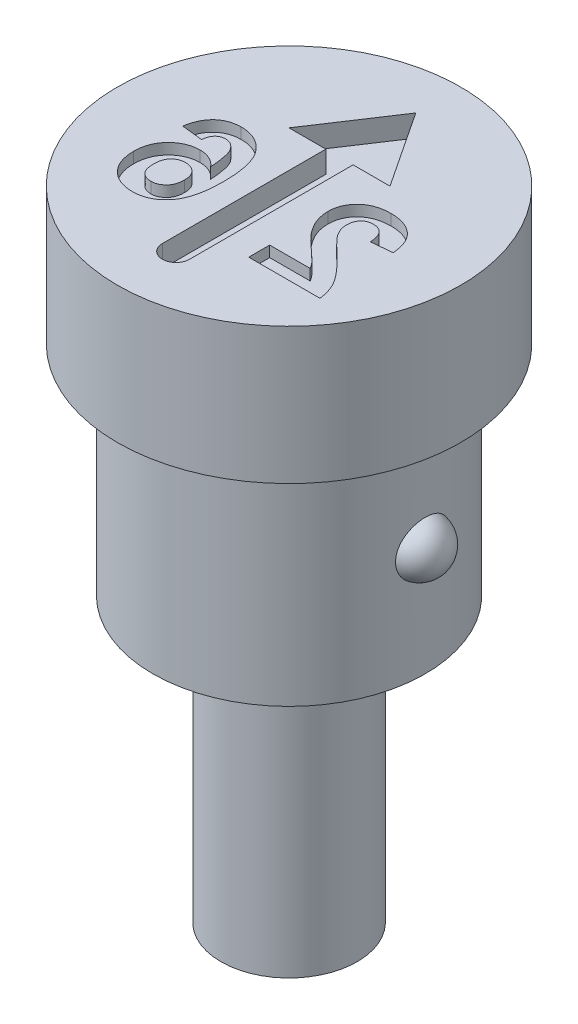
ISO-10303-21;
HEADER;
FILE_DESCRIPTION(('STEP AP214'),'2;1');
FILE_NAME('part.step','',(''),(''),'','','');
FILE_SCHEMA(('AUTOMOTIVE_DESIGN { 1 0 10303 214 1 1 1 1 }'));
ENDSEC;
DATA;
#1=APPLICATION_CONTEXT('core data for automotive mechanical design processes');
#2=APPLICATION_PROTOCOL_DEFINITION('international standard','automotive_design',2000,#1);
#3=PRODUCT_CONTEXT('',#1,'mechanical');
#4=PRODUCT('Part','Part','',(#3));
#5=PRODUCT_RELATED_PRODUCT_CATEGORY('part','',(#4));
#6=PRODUCT_DEFINITION_FORMATION('','',#4);
#7=PRODUCT_DEFINITION_CONTEXT('part definition',#1,'design');
#8=PRODUCT_DEFINITION('design','',#6,#7);
#9=PRODUCT_DEFINITION_SHAPE('','',#8);
#10=(LENGTH_UNIT() NAMED_UNIT(*) SI_UNIT(.MILLI.,.METRE.));
#11=(NAMED_UNIT(*) PLANE_ANGLE_UNIT() SI_UNIT($,.RADIAN.));
#12=(NAMED_UNIT(*) SI_UNIT($,.STERADIAN.) SOLID_ANGLE_UNIT());
#13=UNCERTAINTY_MEASURE_WITH_UNIT(LENGTH_MEASURE(1.E-05),#10,'distance_accuracy_value','');
#14=(GEOMETRIC_REPRESENTATION_CONTEXT(3) GLOBAL_UNCERTAINTY_ASSIGNED_CONTEXT((#13)) GLOBAL_UNIT_ASSIGNED_CONTEXT((#10,
#11,#12)) REPRESENTATION_CONTEXT('',''));
#15=CARTESIAN_POINT('',(0.,0.,0.));
#16=DIRECTION('',(0.,0.,1.));
#17=DIRECTION('',(1.,0.,0.));
#18=AXIS2_PLACEMENT_3D('',#15,#16,#17);
#19=CARTESIAN_POINT('',(0.,0.,0.));
#20=DIRECTION('',(0.,1.,0.));
#21=DIRECTION('',(0.,0.,1.));
#22=AXIS2_PLACEMENT_3D('',#19,#20,#21);
#23=CYLINDRICAL_SURFACE('',#22,2.5);
#24=CARTESIAN_POINT('',(0.,-2.5,0.));
#25=DIRECTION('',(0.,1.,0.));
#26=DIRECTION('',(0.,0.,1.));
#27=AXIS2_PLACEMENT_3D('',#24,#25,#26);
#28=CIRCLE('',#27,2.5);
#29=CARTESIAN_POINT('',(0.,-2.5,2.5));
#30=VERTEX_POINT('',#29);
#31=EDGE_CURVE('E464',#30,#30,#28,.T.);
#32=ORIENTED_EDGE('',*,*,#31,.F.);
#33=EDGE_LOOP('',(#32));
#34=FACE_BOUND('',#33,.T.);
#35=CARTESIAN_POINT('',(0.,-6.5,0.));
#36=DIRECTION('',(0.,1.,0.));
#37=DIRECTION('',(0.,0.,1.));
#38=AXIS2_PLACEMENT_3D('',#35,#36,#37);
#39=CIRCLE('',#38,2.5);
#40=CARTESIAN_POINT('',(0.,-6.5,2.5));
#41=VERTEX_POINT('',#40);
#42=EDGE_CURVE('E467',#41,#41,#39,.T.);
#43=ORIENTED_EDGE('',*,*,#42,.T.);
#44=EDGE_LOOP('',(#43));
#45=FACE_BOUND('',#44,.T.);
#46=CARTESIAN_POINT('',(2.45026890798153,-4.5,-0.496167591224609));
#47=CARTESIAN_POINT('',(2.45026941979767,-4.5268662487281,-0.496166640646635));
#48=CARTESIAN_POINT('',(2.45072698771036,-4.55374499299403,-0.493921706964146));
#49=CARTESIAN_POINT('',(2.45250670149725,-4.60674229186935,-0.485005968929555));
#50=CARTESIAN_POINT('',(2.45382952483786,-4.63286023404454,-0.478331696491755));
#51=CARTESIAN_POINT('',(2.45718801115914,-4.68356109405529,-0.460767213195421));
#52=CARTESIAN_POINT('',(2.45922301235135,-4.70814541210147,-0.449880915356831));
#53=CARTESIAN_POINT('',(2.46377966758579,-4.75513379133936,-0.424215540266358));
#54=CARTESIAN_POINT('',(2.4663012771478,-4.77753805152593,-0.409436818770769));
#55=CARTESIAN_POINT('',(2.47158882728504,-4.81984041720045,-0.37621026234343));
#56=CARTESIAN_POINT('',(2.47435731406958,-4.83970559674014,-0.357720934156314));
#57=CARTESIAN_POINT('',(2.47981238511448,-4.87611210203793,-0.317706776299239));
#58=CARTESIAN_POINT('',(2.48249896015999,-4.89265305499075,-0.296181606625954));
#59=CARTESIAN_POINT('',(2.48755477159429,-4.92230089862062,-0.250230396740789));
#60=CARTESIAN_POINT('',(2.48991659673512,-4.93533258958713,-0.225754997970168));
#61=CARTESIAN_POINT('',(2.49400144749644,-4.95719664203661,-0.174945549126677));
#62=CARTESIAN_POINT('',(2.49572443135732,-4.96602872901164,-0.148611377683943));
#63=CARTESIAN_POINT('',(2.49836056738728,-4.97935096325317,-0.0945245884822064));
#64=CARTESIAN_POINT('',(2.49926478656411,-4.9837932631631,-0.0667597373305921));
#65=CARTESIAN_POINT('',(2.50013265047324,-4.9880592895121,-0.0108628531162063));
#66=CARTESIAN_POINT('',(2.50009627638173,-4.98788292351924,0.0172691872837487));
#67=CARTESIAN_POINT('',(2.49908563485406,-4.98290967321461,0.0731754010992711));
#68=CARTESIAN_POINT('',(2.49810904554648,-4.97810135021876,0.100948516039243));
#69=CARTESIAN_POINT('',(2.49532150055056,-4.96396560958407,0.155276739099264));
#70=CARTESIAN_POINT('',(2.49351053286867,-4.95463812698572,0.18183182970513));
#71=CARTESIAN_POINT('',(2.48925506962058,-4.9317015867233,0.232953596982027));
#72=CARTESIAN_POINT('',(2.48681089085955,-4.91809466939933,0.257521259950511));
#73=CARTESIAN_POINT('',(2.48156118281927,-4.88694160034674,0.303975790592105));
#74=CARTESIAN_POINT('',(2.47875565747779,-4.8693954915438,0.325862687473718));
#75=CARTESIAN_POINT('',(2.47311801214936,-4.8309322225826,0.366197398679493));
#76=CARTESIAN_POINT('',(2.47028613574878,-4.81003489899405,0.384664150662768));
#77=CARTESIAN_POINT('',(2.4649055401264,-4.76536093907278,0.417759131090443));
#78=CARTESIAN_POINT('',(2.46235679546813,-4.74158456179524,0.432387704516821));
#79=CARTESIAN_POINT('',(2.45787929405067,-4.69223108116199,0.457149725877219));
#80=CARTESIAN_POINT('',(2.4559410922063,-4.66668972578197,0.467352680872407));
#81=CARTESIAN_POINT('',(2.4528552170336,-4.61420353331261,0.483288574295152));
#82=CARTESIAN_POINT('',(2.45170743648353,-4.58725888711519,0.489022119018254));
#83=CARTESIAN_POINT('',(2.4503523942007,-4.53332937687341,0.495766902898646));
#84=CARTESIAN_POINT('',(2.45012617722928,-4.5063568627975,0.496873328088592));
#85=CARTESIAN_POINT('',(2.45058785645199,-4.45261180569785,0.494591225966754));
#86=CARTESIAN_POINT('',(2.45127569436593,-4.4258392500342,0.491202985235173));
#87=CARTESIAN_POINT('',(2.4534773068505,-4.37348289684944,0.48008379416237));
#88=CARTESIAN_POINT('',(2.45498416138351,-4.34789106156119,0.472389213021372));
#89=CARTESIAN_POINT('',(2.45865144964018,-4.29836418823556,0.452913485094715));
#90=CARTESIAN_POINT('',(2.46081191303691,-4.27442922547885,0.441132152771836));
#91=CARTESIAN_POINT('',(2.46557820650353,-4.22858883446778,0.413666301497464));
#92=CARTESIAN_POINT('',(2.46818884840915,-4.20670975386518,0.397938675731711));
#93=CARTESIAN_POINT('',(2.47355408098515,-4.16585853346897,0.363097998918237));
#94=CARTESIAN_POINT('',(2.47630868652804,-4.14688669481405,0.343984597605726));
#95=CARTESIAN_POINT('',(2.48172468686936,-4.11195988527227,0.302471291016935));
#96=CARTESIAN_POINT('',(2.48438296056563,-4.09607570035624,0.280011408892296));
#97=CARTESIAN_POINT('',(2.48925607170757,-4.06821889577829,0.232740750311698));
#98=CARTESIAN_POINT('',(2.49147087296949,-4.05624659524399,0.207929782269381));
#99=CARTESIAN_POINT('',(2.49524821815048,-4.03635632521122,0.156258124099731));
#100=CARTESIAN_POINT('',(2.49680057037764,-4.02850130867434,0.129372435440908));
#101=CARTESIAN_POINT('',(2.49903554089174,-4.01731173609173,0.0746411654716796));
#102=CARTESIAN_POINT('',(2.49971812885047,-4.01397733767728,0.0467955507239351));
#103=CARTESIAN_POINT('',(2.50014060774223,-4.01190531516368,-0.00921056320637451));
#104=CARTESIAN_POINT('',(2.499875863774,-4.01319029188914,-0.0373719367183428));
#105=CARTESIAN_POINT('',(2.49842219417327,-4.02037605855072,-0.0930754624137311));
#106=CARTESIAN_POINT('',(2.49723325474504,-4.02627691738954,-0.120617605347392));
#107=CARTESIAN_POINT('',(2.49406090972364,-4.04255213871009,-0.174310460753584));
#108=CARTESIAN_POINT('',(2.49207720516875,-4.0529281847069,-0.200460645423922));
#109=CARTESIAN_POINT('',(2.48753466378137,-4.07789544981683,-0.250611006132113));
#110=CARTESIAN_POINT('',(2.48497583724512,-4.09248659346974,-0.27461122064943));
#111=CARTESIAN_POINT('',(2.47957795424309,-4.12546237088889,-0.319699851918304));
#112=CARTESIAN_POINT('',(2.4767397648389,-4.1438354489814,-0.34079681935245));
#113=CARTESIAN_POINT('',(2.47109866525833,-4.18392463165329,-0.37954675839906));
#114=CARTESIAN_POINT('',(2.46829575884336,-4.20564108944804,-0.39719936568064));
#115=CARTESIAN_POINT('',(2.4630825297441,-4.25154435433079,-0.428335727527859));
#116=CARTESIAN_POINT('',(2.46066796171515,-4.27569895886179,-0.441866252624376));
#117=CARTESIAN_POINT('',(2.45647527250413,-4.32599598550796,-0.464611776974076));
#118=CARTESIAN_POINT('',(2.45469654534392,-4.35213648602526,-0.473830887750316));
#119=CARTESIAN_POINT('',(2.4523384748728,-4.39862136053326,-0.485862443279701));
#120=CARTESIAN_POINT('',(2.45156706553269,-4.41869210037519,-0.489720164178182));
#121=CARTESIAN_POINT('',(2.45053209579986,-4.45917282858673,-0.494873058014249));
#122=CARTESIAN_POINT('',(2.45026851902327,-4.4795828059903,-0.496168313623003));
#123=CARTESIAN_POINT('',(2.45026890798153,-4.5,-0.496167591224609));
#124=B_SPLINE_CURVE_WITH_KNOTS('',3,(#46,#47,#48,#49,#50,#51,#52,#53,#54,#55,#56,#57,#58,#59,
#60,#61,#62,#63,#64,#65,#66,#67,#68,#69,#70,#71,#72,#73,#74,#75,#76,#77,#78,#79,#80,#81,#82,#83,
#84,#85,#86,#87,#88,#89,#90,#91,#92,#93,#94,#95,#96,#97,#98,#99,#100,#101,#102,#103,#104,#105,
#106,#107,#108,#109,#110,#111,#112,#113,#114,#115,#116,#117,#118,#119,#120,#121,#122,#123),
.UNSPECIFIED.,.T.,.F.,(4,2,2,2,2,2,2,2,2,2,2,2,2,2,2,2,2,2,2,2,2,2,2,2,2,2,2,2,2,2,2,2,2,2,2,2,
2,2,4),(0.,0.0805239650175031,0.161111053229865,0.241623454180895,0.322128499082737,
0.403589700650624,0.485060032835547,0.568157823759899,0.651261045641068,0.735260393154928,
0.819261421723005,0.903470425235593,0.987680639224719,1.07184880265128,1.15601604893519,
1.23970232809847,1.32338108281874,1.40569330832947,1.48799436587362,1.56859379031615,
1.64918807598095,1.72911175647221,1.80903906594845,1.88988066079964,1.97073062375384,
2.05325859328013,2.13579329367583,2.21955561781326,2.30332086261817,2.38749649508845,
2.4716733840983,2.55588196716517,2.64008904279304,2.72404254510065,2.80800492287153,
2.89097573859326,2.97386726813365,3.03506399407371,3.09625874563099),.UNSPECIFIED.);
#125=CARTESIAN_POINT('',(2.45026890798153,-4.5,-0.496167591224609));
#126=VERTEX_POINT('',#125);
#127=EDGE_CURVE('E41',#126,#126,#124,.T.);
#128=ORIENTED_EDGE('',*,*,#127,.T.);
#129=EDGE_LOOP('',(#128));
#130=FACE_BOUND('',#129,.T.);
#131=ADVANCED_FACE('F37',(#34,#45,#130),#23,.T.);
#132=CARTESIAN_POINT('',(0.,0.,0.));
#133=DIRECTION('',(0.,1.,0.));
#134=DIRECTION('',(0.,0.,1.));
#135=AXIS2_PLACEMENT_3D('',#132,#133,#134);
#136=PLANE('',#135);
#137=DIRECTION('',(-1.,0.,0.));
#138=VECTOR('',#137,1.);
#139=CARTESIAN_POINT('',(1.50238477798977,0.,1.11435643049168));
#140=LINE('',#139,#138);
#141=CARTESIAN_POINT('',(1.50238477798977,0.,1.11435643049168));
#142=VERTEX_POINT('',#141);
#143=CARTESIAN_POINT('',(0.759195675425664,0.,1.11435643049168));
#144=VERTEX_POINT('',#143);
#145=EDGE_CURVE('E58',#142,#144,#140,.T.);
#146=ORIENTED_EDGE('',*,*,#145,.F.);
#147=CARTESIAN_POINT('',(0.953105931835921,0.,0.544644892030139));
#148=CARTESIAN_POINT('',(0.959189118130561,0.,0.552306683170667));
#149=CARTESIAN_POINT('',(0.972217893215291,0.,0.568716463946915));
#150=CARTESIAN_POINT('',(0.994383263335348,0.,0.593878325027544));
#151=CARTESIAN_POINT('',(1.0200710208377,0.,0.621363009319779));
#152=CARTESIAN_POINT('',(1.04891833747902,0.,0.651684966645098));
#153=CARTESIAN_POINT('',(1.08187809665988,0.,0.68377041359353));
#154=CARTESIAN_POINT('',(1.11776440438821,0.,0.718961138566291));
#155=CARTESIAN_POINT('',(1.15815636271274,0.,0.755457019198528));
#156=CARTESIAN_POINT('',(1.19999264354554,0.,0.794168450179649));
#157=CARTESIAN_POINT('',(1.24201077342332,0.,0.83184574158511));
#158=CARTESIAN_POINT('',(1.28063149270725,0.,0.867630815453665));
#159=CARTESIAN_POINT('',(1.31571195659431,0.,0.899292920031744));
#160=CARTESIAN_POINT('',(1.34561840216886,0.,0.928579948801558));
#161=CARTESIAN_POINT('',(1.37210991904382,0.,0.953493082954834));
#162=CARTESIAN_POINT('',(1.3942316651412,0.,0.975309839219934));
#163=CARTESIAN_POINT('',(1.41239759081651,0.,0.993502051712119));
#164=CARTESIAN_POINT('',(1.43742906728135,0.,1.02185909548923));
#165=CARTESIAN_POINT('',(1.46927878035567,0.,1.06021200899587));
#166=CARTESIAN_POINT('',(1.49168635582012,0.,1.09685930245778));
#167=CARTESIAN_POINT('',(1.50238477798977,0.,1.11435643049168));
#168=B_SPLINE_CURVE_WITH_KNOTS('',3,(#147,#148,#149,#150,#151,#152,#153,#154,#155,#156,#157,
#158,#159,#160,#161,#162,#163,#164,#165,#166,#167),.UNSPECIFIED.,.F.,.F.,(4,1,1,1,1,1,1,1,1,1,1,
1,1,1,1,1,1,1,4),(0.,0.0369753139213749,0.0791925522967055,0.126700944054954,0.179184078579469,
0.23736864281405,0.300558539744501,0.369153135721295,0.443112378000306,0.516018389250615,
0.582473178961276,0.642136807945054,0.694619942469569,0.740679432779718,0.779589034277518,
0.812073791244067,0.837814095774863,0.922564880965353,1.),.UNSPECIFIED.);
#169=CARTESIAN_POINT('',(0.953105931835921,0.,0.544644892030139));
#170=VERTEX_POINT('',#169);
#171=EDGE_CURVE('E279',#170,#142,#168,.T.);
#172=ORIENTED_EDGE('',*,*,#171,.F.);
#173=CARTESIAN_POINT('',(0.759195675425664,0.,0.0430423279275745));
#174=CARTESIAN_POINT('',(0.759684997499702,0.,0.0648432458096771));
#175=CARTESIAN_POINT('',(0.760655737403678,0.,0.108092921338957));
#176=CARTESIAN_POINT('',(0.769949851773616,0.,0.172028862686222));
#177=CARTESIAN_POINT('',(0.784149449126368,0.,0.234490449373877));
#178=CARTESIAN_POINT('',(0.80513533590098,0.,0.295630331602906));
#179=CARTESIAN_POINT('',(0.831736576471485,0.,0.356915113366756));
#180=CARTESIAN_POINT('',(0.866026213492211,0.,0.418482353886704));
#181=CARTESIAN_POINT('',(0.905839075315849,0.,0.482188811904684));
#182=CARTESIAN_POINT('',(0.937010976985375,0.,0.523377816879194));
#183=CARTESIAN_POINT('',(0.953105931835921,0.,0.544644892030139));
#184=B_SPLINE_CURVE_WITH_KNOTS('',3,(#173,#174,#175,#176,#177,#178,#179,#180,#181,#182,#183),
.UNSPECIFIED.,.F.,.F.,(4,1,1,1,1,1,1,1,4),(0.,0.119176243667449,0.236427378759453,
0.352663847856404,0.469086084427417,0.589462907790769,0.717601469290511,0.854189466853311,1.),.UNSPECIFIED.);
#185=CARTESIAN_POINT('',(0.759195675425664,0.,0.0430423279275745));
#186=VERTEX_POINT('',#185);
#187=EDGE_CURVE('E282',#186,#170,#184,.T.);
#188=ORIENTED_EDGE('',*,*,#187,.F.);
#189=CARTESIAN_POINT('',(1.37297772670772,0.,-0.501028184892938));
#190=CARTESIAN_POINT('',(1.34972334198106,0.,-0.500581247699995));
#191=CARTESIAN_POINT('',(1.30443250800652,0.,-0.499710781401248));
#192=CARTESIAN_POINT('',(1.23831593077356,0.,-0.492522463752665));
#193=CARTESIAN_POINT('',(1.17620415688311,0.,-0.479988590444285));
#194=CARTESIAN_POINT('',(1.11755416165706,0.,-0.463385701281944));
#195=CARTESIAN_POINT('',(1.0629682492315,0.,-0.441219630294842));
#196=CARTESIAN_POINT('',(1.01199155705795,0.,-0.414421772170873));
#197=CARTESIAN_POINT('',(0.965426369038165,0.,-0.381975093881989));
#198=CARTESIAN_POINT('',(0.922578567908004,0.,-0.345649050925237));
#199=CARTESIAN_POINT('',(0.884276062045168,0.,-0.305702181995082));
#200=CARTESIAN_POINT('',(0.850726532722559,0.,-0.263092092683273));
#201=CARTESIAN_POINT('',(0.822618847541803,0.,-0.217848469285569));
#202=CARTESIAN_POINT('',(0.799032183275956,0.,-0.170522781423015));
#203=CARTESIAN_POINT('',(0.781519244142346,0.,-0.120353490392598));
#204=CARTESIAN_POINT('',(0.768758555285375,0.,-0.0680342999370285));
#205=CARTESIAN_POINT('',(0.760297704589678,0.,-0.0133211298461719));
#206=CARTESIAN_POINT('',(0.75956708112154,0.,0.024046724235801));
#207=CARTESIAN_POINT('',(0.759195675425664,0.,0.0430423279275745));
#208=B_SPLINE_CURVE_WITH_KNOTS('',3,(#189,#190,#191,#192,#193,#194,#195,#196,#197,#198,#199,
#200,#201,#202,#203,#204,#205,#206,#207),.UNSPECIFIED.,.F.,.F.,(4,1,1,1,1,1,1,1,1,1,1,1,1,1,1,1,
4),(0.,0.0756723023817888,0.147381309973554,0.216084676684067,0.28169803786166,
0.345459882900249,0.407485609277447,0.46873129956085,0.529782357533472,0.590032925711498,
0.648548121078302,0.70595351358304,0.763101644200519,0.820289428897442,0.878479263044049,
0.938226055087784,1.),.UNSPECIFIED.);
#209=CARTESIAN_POINT('',(1.37297772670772,0.,-0.501028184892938));
#210=VERTEX_POINT('',#209);
#211=EDGE_CURVE('E1223',#210,#186,#208,.T.);
#212=ORIENTED_EDGE('',*,*,#211,.F.);
#213=CARTESIAN_POINT('',(2.01560593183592,0.,0.102337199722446));
#214=CARTESIAN_POINT('',(2.01251368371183,0.,0.0763708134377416));
#215=CARTESIAN_POINT('',(2.00651830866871,0.,0.0260261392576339));
#216=CARTESIAN_POINT('',(1.99155674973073,0.,-0.0462861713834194));
#217=CARTESIAN_POINT('',(1.97260848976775,0.,-0.112997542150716));
#218=CARTESIAN_POINT('',(1.94877020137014,0.,-0.173984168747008));
#219=CARTESIAN_POINT('',(1.92102714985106,0.,-0.229633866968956));
#220=CARTESIAN_POINT('',(1.88796420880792,0.,-0.279111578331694));
#221=CARTESIAN_POINT('',(1.85073663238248,0.,-0.322965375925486));
#222=CARTESIAN_POINT('',(1.80931224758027,0.,-0.361171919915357));
#223=CARTESIAN_POINT('',(1.76395440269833,0.,-0.39385275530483));
#224=CARTESIAN_POINT('',(1.71635948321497,0.,-0.423025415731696));
#225=CARTESIAN_POINT('',(1.6655973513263,0.,-0.446956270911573));
#226=CARTESIAN_POINT('',(1.61222689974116,0.,-0.466678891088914));
#227=CARTESIAN_POINT('',(1.5562722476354,0.,-0.482441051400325));
#228=CARTESIAN_POINT('',(1.49747459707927,0.,-0.492862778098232));
#229=CARTESIAN_POINT('',(1.43619682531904,0.,-0.500193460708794));
#230=CARTESIAN_POINT('',(1.39436836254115,0.,-0.500745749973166));
#231=CARTESIAN_POINT('',(1.37297772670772,0.,-0.501028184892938));
#232=B_SPLINE_CURVE_WITH_KNOTS('',3,(#213,#214,#215,#216,#217,#218,#219,#220,#221,#222,#223,
#224,#225,#226,#227,#228,#229,#230,#231),.UNSPECIFIED.,.F.,.F.,(4,1,1,1,1,1,1,1,1,1,1,1,1,1,1,1,
4),(0.,0.0794357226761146,0.154013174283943,0.224141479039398,0.289934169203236,
0.352732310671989,0.41272577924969,0.470302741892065,0.527168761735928,0.583502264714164,
0.639948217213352,0.696584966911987,0.753726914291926,0.812707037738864,0.872963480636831,
0.93503486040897,1.),.UNSPECIFIED.);
#233=CARTESIAN_POINT('',(2.01560593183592,0.,0.102337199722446));
#234=VERTEX_POINT('',#233);
#235=EDGE_CURVE('E1218',#234,#210,#232,.T.);
#236=ORIENTED_EDGE('',*,*,#235,.F.);
#237=DIRECTION('',(0.995240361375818,0.,-0.0974506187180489));
#238=VECTOR('',#237,1.);
#239=CARTESIAN_POINT('',(1.63099054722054,0.,0.139997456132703));
#240=LINE('',#239,#238);
#241=CARTESIAN_POINT('',(1.63099054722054,0.,0.139997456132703));
#242=VERTEX_POINT('',#241);
#243=EDGE_CURVE('E1212',#242,#234,#240,.T.);
#244=ORIENTED_EDGE('',*,*,#243,.F.);
#245=CARTESIAN_POINT('',(1.38099054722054,0.,-0.167694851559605));
#246=CARTESIAN_POINT('',(1.3984350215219,0.,-0.16690450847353));
#247=CARTESIAN_POINT('',(1.43213397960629,0.,-0.16537773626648));
#248=CARTESIAN_POINT('',(1.48002751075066,0.,-0.152040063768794));
#249=CARTESIAN_POINT('',(1.52192551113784,0.,-0.12895114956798));
#250=CARTESIAN_POINT('',(1.55178425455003,0.,-0.102639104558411));
#251=CARTESIAN_POINT('',(1.57195525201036,0.,-0.0770525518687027));
#252=CARTESIAN_POINT('',(1.58569906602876,0.,-0.0547555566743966));
#253=CARTESIAN_POINT('',(1.59754516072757,0.,-0.0294193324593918));
#254=CARTESIAN_POINT('',(1.60804178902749,0.,-0.00132912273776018));
#255=CARTESIAN_POINT('',(1.61633293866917,0.,0.029836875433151));
#256=CARTESIAN_POINT('',(1.62301011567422,0.,0.0638413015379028));
#257=CARTESIAN_POINT('',(1.62839095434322,0.,0.100867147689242));
#258=CARTESIAN_POINT('',(1.63010215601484,0.,0.126624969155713));
#259=CARTESIAN_POINT('',(1.63099054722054,0.,0.139997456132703));
#260=B_SPLINE_CURVE_WITH_KNOTS('',3,(#245,#246,#247,#248,#249,#250,#251,#252,#253,#254,#255,
#256,#257,#258,#259),.UNSPECIFIED.,.F.,.F.,(4,1,1,1,1,1,1,1,1,1,1,1,4),(0.,0.116899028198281,
0.225823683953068,0.330086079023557,0.435451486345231,0.490306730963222,0.548244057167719,
0.610766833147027,0.677675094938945,0.749188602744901,0.826858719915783,0.910111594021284,1.),.UNSPECIFIED.);
#261=CARTESIAN_POINT('',(1.38099054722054,0.,-0.167694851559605));
#262=VERTEX_POINT('',#261);
#263=EDGE_CURVE('E1204',#262,#242,#260,.T.);
#264=ORIENTED_EDGE('',*,*,#263,.F.);
#265=CARTESIAN_POINT('',(1.14381106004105,0.,0.0947250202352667));
#266=CARTESIAN_POINT('',(1.14453139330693,0.,0.0747702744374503));
#267=CARTESIAN_POINT('',(1.14589420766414,0.,0.0370174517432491));
#268=CARTESIAN_POINT('',(1.15732164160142,0.,-0.016258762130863));
#269=CARTESIAN_POINT('',(1.17758634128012,0.,-0.0620572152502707));
#270=CARTESIAN_POINT('',(1.20548710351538,0.,-0.100518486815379));
#271=CARTESIAN_POINT('',(1.24076767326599,0.,-0.130652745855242));
#272=CARTESIAN_POINT('',(1.28201168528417,0.,-0.152919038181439));
#273=CARTESIAN_POINT('',(1.32982288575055,0.,-0.165229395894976));
#274=CARTESIAN_POINT('',(1.36342741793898,0.,-0.166848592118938));
#275=CARTESIAN_POINT('',(1.38099054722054,0.,-0.167694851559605));
#276=B_SPLINE_CURVE_WITH_KNOTS('',3,(#265,#266,#267,#268,#269,#270,#271,#272,#273,#274,#275),
.UNSPECIFIED.,.F.,.F.,(4,1,1,1,1,1,1,1,4),(0.,0.149140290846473,0.282161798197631,
0.404655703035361,0.521109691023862,0.634416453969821,0.748796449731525,0.868710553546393,1.),.UNSPECIFIED.);
#277=CARTESIAN_POINT('',(1.14381106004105,0.,0.0947250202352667));
#278=VERTEX_POINT('',#277);
#279=EDGE_CURVE('E1196',#278,#262,#276,.T.);
#280=ORIENTED_EDGE('',*,*,#279,.F.);
#281=CARTESIAN_POINT('',(1.21993285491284,0.,0.325894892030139));
#282=CARTESIAN_POINT('',(1.2083529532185,0.,0.306659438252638));
#283=CARTESIAN_POINT('',(1.18601666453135,0.,0.2695564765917));
#284=CARTESIAN_POINT('',(1.16152307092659,0.,0.211211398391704));
#285=CARTESIAN_POINT('',(1.14682110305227,0.,0.152878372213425));
#286=CARTESIAN_POINT('',(1.14480359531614,0.,0.113900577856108));
#287=CARTESIAN_POINT('',(1.14381106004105,0.,0.0947250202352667));
#288=B_SPLINE_CURVE_WITH_KNOTS('',3,(#281,#282,#283,#284,#285,#286,#287),.UNSPECIFIED.,.F.,.F.,
(4,1,1,1,4),(0.,0.272795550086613,0.526191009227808,0.766904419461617,1.),.UNSPECIFIED.);
#289=CARTESIAN_POINT('',(1.21993285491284,0.,0.325894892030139));
#290=VERTEX_POINT('',#289);
#291=EDGE_CURVE('E1188',#290,#278,#288,.T.);
#292=ORIENTED_EDGE('',*,*,#291,.F.);
#293=CARTESIAN_POINT('',(1.52602259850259,0.,0.648811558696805));
#294=CARTESIAN_POINT('',(1.50624853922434,0.,0.629724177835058));
#295=CARTESIAN_POINT('',(1.46860455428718,0.,0.593387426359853));
#296=CARTESIAN_POINT('',(1.41499944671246,0.,0.54135467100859));
#297=CARTESIAN_POINT('',(1.36787503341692,0.,0.493521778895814));
#298=CARTESIAN_POINT('',(1.32624600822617,0.,0.451128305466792));
#299=CARTESIAN_POINT('',(1.29107406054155,0.,0.4130948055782));
#300=CARTESIAN_POINT('',(1.26189653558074,0.,0.380018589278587));
#301=CARTESIAN_POINT('',(1.23834390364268,0.,0.351764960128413));
#302=CARTESIAN_POINT('',(1.22558777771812,0.,0.333840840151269));
#303=CARTESIAN_POINT('',(1.21993285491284,0.,0.325894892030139));
#304=B_SPLINE_CURVE_WITH_KNOTS('',3,(#293,#294,#295,#296,#297,#298,#299,#300,#301,#302,#303),
.UNSPECIFIED.,.F.,.F.,(4,1,1,1,1,1,1,1,4),(0.,0.18509006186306,0.352356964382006,
0.503079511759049,0.637279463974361,0.752473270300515,0.851885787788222,0.934339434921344,1.),.UNSPECIFIED.);
#305=CARTESIAN_POINT('',(1.52602259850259,0.,0.648811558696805));
#306=VERTEX_POINT('',#305);
#307=EDGE_CURVE('E1180',#306,#290,#304,.T.);
#308=ORIENTED_EDGE('',*,*,#307,.F.);
#309=CARTESIAN_POINT('',(2.06688798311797,0.,1.49897181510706));
#310=CARTESIAN_POINT('',(2.06246043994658,0.,1.46610085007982));
#311=CARTESIAN_POINT('',(2.05360783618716,0.,1.40037735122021));
#312=CARTESIAN_POINT('',(2.02623875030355,0.,1.30437186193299));
#313=CARTESIAN_POINT('',(1.98971039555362,0.,1.21068690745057));
#314=CARTESIAN_POINT('',(1.9500658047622,0.,1.13445009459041));
#315=CARTESIAN_POINT('',(1.91063486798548,0.,1.0730820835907));
#316=CARTESIAN_POINT('',(1.87485917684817,0.,1.02279666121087));
#317=CARTESIAN_POINT('',(1.83218009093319,0.,0.969295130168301));
#318=CARTESIAN_POINT('',(1.7832169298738,0.,0.912145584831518));
#319=CARTESIAN_POINT('',(1.72824028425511,0.,0.851169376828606));
#320=CARTESIAN_POINT('',(1.66683999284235,0.,0.786593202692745));
#321=CARTESIAN_POINT('',(1.59872316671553,0.,0.718726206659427));
#322=CARTESIAN_POINT('',(1.55080176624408,0.,0.672641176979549));
#323=CARTESIAN_POINT('',(1.52602259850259,0.,0.648811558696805));
#324=B_SPLINE_CURVE_WITH_KNOTS('',3,(#309,#310,#311,#312,#313,#314,#315,#316,#317,#318,#319,
#320,#321,#322,#323),.UNSPECIFIED.,.F.,.F.,(4,1,1,1,1,1,1,1,1,1,1,1,4),(0.,0.0963574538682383,
0.192660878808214,0.289454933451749,0.388479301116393,0.441921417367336,0.501521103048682,
0.567882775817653,0.640891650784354,0.72037065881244,0.806636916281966,0.900015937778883,1.),.UNSPECIFIED.);
#325=CARTESIAN_POINT('',(2.06688798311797,0.,1.49897181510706));
#326=VERTEX_POINT('',#325);
#327=EDGE_CURVE('E1175',#326,#306,#324,.T.);
#328=ORIENTED_EDGE('',*,*,#327,.F.);
#329=DIRECTION('',(1.,0.,0.));
#330=VECTOR('',#329,1.);
#331=CARTESIAN_POINT('',(0.759195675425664,0.,1.49897181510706));
#332=LINE('',#331,#330);
#333=CARTESIAN_POINT('',(0.759195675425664,0.,1.49897181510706));
#334=VERTEX_POINT('',#333);
#335=EDGE_CURVE('E1172',#334,#326,#332,.T.);
#336=ORIENTED_EDGE('',*,*,#335,.F.);
#337=DIRECTION('',(0.,0.,1.));
#338=VECTOR('',#337,1.);
#339=CARTESIAN_POINT('',(0.759195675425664,0.,1.11435643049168));
#340=LINE('',#339,#338);
#341=EDGE_CURVE('E1170',#144,#334,#340,.T.);
#342=ORIENTED_EDGE('',*,*,#341,.F.);
#343=EDGE_LOOP('',(#146,#172,#188,#212,#236,#244,#264,#280,#292,#308,#328,#336,#342));
#344=FACE_BOUND('',#343,.T.);
#345=CARTESIAN_POINT('',(-1.37910560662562,0.,-0.501028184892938));
#346=CARTESIAN_POINT('',(-1.39715613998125,0.,-0.500703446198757));
#347=CARTESIAN_POINT('',(-1.43244262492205,0.,-0.500068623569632));
#348=CARTESIAN_POINT('',(-1.48416004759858,0.,-0.49332733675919));
#349=CARTESIAN_POINT('',(-1.53349798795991,0.,-0.483018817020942));
#350=CARTESIAN_POINT('',(-1.58058575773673,0.,-0.468749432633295));
#351=CARTESIAN_POINT('',(-1.62509182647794,0.,-0.449639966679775));
#352=CARTESIAN_POINT('',(-1.66719292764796,0.,-0.426360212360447));
#353=CARTESIAN_POINT('',(-1.70703059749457,0.,-0.398973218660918));
#354=CARTESIAN_POINT('',(-1.74439755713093,0.,-0.367655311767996));
#355=CARTESIAN_POINT('',(-1.77899306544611,0.,-0.332311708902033));
#356=CARTESIAN_POINT('',(-1.81023200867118,0.,-0.292862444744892));
#357=CARTESIAN_POINT('',(-1.83832126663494,0.,-0.24978362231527));
#358=CARTESIAN_POINT('',(-1.86338377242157,0.,-0.203110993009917));
#359=CARTESIAN_POINT('',(-1.88440578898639,0.,-0.152397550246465));
#360=CARTESIAN_POINT('',(-1.90247768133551,0.,-0.0980420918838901));
#361=CARTESIAN_POINT('',(-1.91734055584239,0.,-0.0399278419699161));
#362=CARTESIAN_POINT('',(-1.92438196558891,0.,0.000385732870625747));
#363=CARTESIAN_POINT('',(-1.92798381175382,0.,0.0210070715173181));
#364=B_SPLINE_CURVE_WITH_KNOTS('',3,(#345,#346,#347,#348,#349,#350,#351,#352,#353,#354,#355,
#356,#357,#358,#359,#360,#361,#362,#363),.UNSPECIFIED.,.F.,.F.,(4,1,1,1,1,1,1,1,1,1,1,1,1,1,1,1,
4),(0.,0.0647517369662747,0.126581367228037,0.186839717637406,0.245514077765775,
0.302849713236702,0.360345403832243,0.417912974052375,0.476091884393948,0.535068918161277,
0.59510381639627,0.656390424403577,0.719434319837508,0.784953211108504,0.853160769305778,
0.924888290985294,1.),.UNSPECIFIED.);
#365=CARTESIAN_POINT('',(-1.37910560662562,0.,-0.501028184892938));
#366=VERTEX_POINT('',#365);
#367=CARTESIAN_POINT('',(-1.92798381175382,0.,0.0210070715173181));
#368=VERTEX_POINT('',#367);
#369=EDGE_CURVE('E66',#366,#368,#364,.T.);
#370=ORIENTED_EDGE('',*,*,#369,.F.);
#371=CARTESIAN_POINT('',(-0.671573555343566,0.,0.52581476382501));
#372=CARTESIAN_POINT('',(-0.672171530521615,0.,0.481993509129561));
#373=CARTESIAN_POINT('',(-0.673326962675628,0.,0.397320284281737));
#374=CARTESIAN_POINT('',(-0.682624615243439,0.,0.275063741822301));
#375=CARTESIAN_POINT('',(-0.69739311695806,0.,0.162165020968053));
#376=CARTESIAN_POINT('',(-0.718907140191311,0.,0.0588787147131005));
#377=CARTESIAN_POINT('',(-0.746425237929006,0.,-0.0350094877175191));
#378=CARTESIAN_POINT('',(-0.779786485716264,0.,-0.119688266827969));
#379=CARTESIAN_POINT('',(-0.819829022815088,0.,-0.194851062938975));
#380=CARTESIAN_POINT('',(-0.866384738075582,0.,-0.260253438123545));
#381=CARTESIAN_POINT('',(-0.917609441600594,0.,-0.317105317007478));
#382=CARTESIAN_POINT('',(-0.972650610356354,0.,-0.366178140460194));
#383=CARTESIAN_POINT('',(-1.03129811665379,0.,-0.407946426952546));
#384=CARTESIAN_POINT('',(-1.09355055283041,0.,-0.442304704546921));
#385=CARTESIAN_POINT('',(-1.1599189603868,0.,-0.46835152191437));
#386=CARTESIAN_POINT('',(-1.22977381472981,0.,-0.487160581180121));
#387=CARTESIAN_POINT('',(-1.30323244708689,0.,-0.499248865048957));
#388=CARTESIAN_POINT('',(-1.35355044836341,0.,-0.500428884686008));
#389=CARTESIAN_POINT('',(-1.37910560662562,0.,-0.501028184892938));
#390=B_SPLINE_CURVE_WITH_KNOTS('',3,(#371,#372,#373,#374,#375,#376,#377,#378,#379,#380,#381,
#382,#383,#384,#385,#386,#387,#388,#389),.UNSPECIFIED.,.F.,.F.,(4,1,1,1,1,1,1,1,1,1,1,1,1,1,1,1,
4),(0.,0.0932311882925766,0.180145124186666,0.260720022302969,0.335343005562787,
0.40439372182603,0.46866345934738,0.528671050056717,0.585123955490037,0.639046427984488,
0.691174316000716,0.741714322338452,0.791946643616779,0.84207517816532,0.893016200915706,
0.945665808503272,1.),.UNSPECIFIED.);
#391=CARTESIAN_POINT('',(-0.671573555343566,0.,0.52581476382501));
#392=VERTEX_POINT('',#391);
#393=EDGE_CURVE('E386',#392,#366,#390,.T.);
#394=ORIENTED_EDGE('',*,*,#393,.F.);
#395=CARTESIAN_POINT('',(-1.35025945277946,0.,1.52461284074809));
#396=CARTESIAN_POINT('',(-1.32604818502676,0.,1.52393547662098));
#397=CARTESIAN_POINT('',(-1.27844452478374,0.,1.52260365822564));
#398=CARTESIAN_POINT('',(-1.20875805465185,0.,1.51164346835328));
#399=CARTESIAN_POINT('',(-1.142506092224,0.,1.49310056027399));
#400=CARTESIAN_POINT('',(-1.07969686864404,0.,1.467204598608));
#401=CARTESIAN_POINT('',(-1.01980833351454,0.,1.43463148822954));
#402=CARTESIAN_POINT('',(-0.963396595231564,0.,1.39416974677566));
#403=CARTESIAN_POINT('',(-0.910611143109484,0.,1.3462052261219));
#404=CARTESIAN_POINT('',(-0.860753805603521,0.,1.29138747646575));
#405=CARTESIAN_POINT('',(-0.81538496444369,0.,1.22806864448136));
#406=CARTESIAN_POINT('',(-0.776748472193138,0.,1.15488539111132));
#407=CARTESIAN_POINT('',(-0.743980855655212,0.,1.07263921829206));
#408=CARTESIAN_POINT('',(-0.717303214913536,0.,0.981119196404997));
#409=CARTESIAN_POINT('',(-0.696710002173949,0.,0.88033258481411));
#410=CARTESIAN_POINT('',(-0.682340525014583,0.,0.770270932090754));
#411=CARTESIAN_POINT('',(-0.672796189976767,0.,0.651116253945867));
#412=CARTESIAN_POINT('',(-0.671990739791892,0.,0.568569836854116));
#413=CARTESIAN_POINT('',(-0.671573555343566,0.,0.52581476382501));
#414=B_SPLINE_CURVE_WITH_KNOTS('',3,(#395,#396,#397,#398,#399,#400,#401,#402,#403,#404,#405,
#406,#407,#408,#409,#410,#411,#412,#413),.UNSPECIFIED.,.F.,.F.,(4,1,1,1,1,1,1,1,1,1,1,1,1,1,1,1,
4),(0.,0.0532594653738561,0.104717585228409,0.154775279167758,0.20433007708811,0.25391362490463,
0.304476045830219,0.356706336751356,0.410596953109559,0.467274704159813,0.52762561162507,
0.59224090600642,0.661798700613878,0.737130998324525,0.818387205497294,0.905933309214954,1.),.UNSPECIFIED.);
#415=CARTESIAN_POINT('',(-1.35025945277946,0.,1.52461284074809));
#416=VERTEX_POINT('',#415);
#417=EDGE_CURVE('E558',#416,#392,#414,.T.);
#418=ORIENTED_EDGE('',*,*,#417,.F.);
#419=CARTESIAN_POINT('',(-1.97926586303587,0.,0.872369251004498));
#420=CARTESIAN_POINT('',(-1.97871070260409,0.,0.896427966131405));
#421=CARTESIAN_POINT('',(-1.97762800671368,0.,0.943348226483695));
#422=CARTESIAN_POINT('',(-1.96965860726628,0.,1.012064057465));
#423=CARTESIAN_POINT('',(-1.95558126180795,0.,1.0769240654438));
#424=CARTESIAN_POINT('',(-1.93634856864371,0.,1.138448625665));
#425=CARTESIAN_POINT('',(-1.91147163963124,0.,1.19615022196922));
#426=CARTESIAN_POINT('',(-1.88133525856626,0.,1.25050437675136));
#427=CARTESIAN_POINT('',(-1.84491958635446,0.,1.30058222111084));
#428=CARTESIAN_POINT('',(-1.80387725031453,0.,1.34705737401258));
#429=CARTESIAN_POINT('',(-1.75812316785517,0.,1.38853043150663));
#430=CARTESIAN_POINT('',(-1.70936230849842,0.,1.4252553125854));
#431=CARTESIAN_POINT('',(-1.65705384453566,0.,1.45578363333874));
#432=CARTESIAN_POINT('',(-1.60197095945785,0.,1.48147844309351));
#433=CARTESIAN_POINT('',(-1.54316756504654,0.,1.50033506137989));
#434=CARTESIAN_POINT('',(-1.48168035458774,0.,1.5144765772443));
#435=CARTESIAN_POINT('',(-1.41700935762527,0.,1.52310163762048));
#436=CARTESIAN_POINT('',(-1.37285553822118,0.,1.52410127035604));
#437=CARTESIAN_POINT('',(-1.35025945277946,0.,1.52461284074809));
#438=B_SPLINE_CURVE_WITH_KNOTS('',3,(#419,#420,#421,#422,#423,#424,#425,#426,#427,#428,#429,
#430,#431,#432,#433,#434,#435,#436,#437),.UNSPECIFIED.,.F.,.F.,(4,1,1,1,1,1,1,1,1,1,1,1,1,1,1,1,
4),(0.,0.0708046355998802,0.138086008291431,0.203231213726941,0.265884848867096,
0.327509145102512,0.387868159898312,0.448411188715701,0.509386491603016,0.570040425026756,
0.629864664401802,0.688715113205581,0.747985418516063,0.80839432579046,0.870086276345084,
0.933515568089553,1.),.UNSPECIFIED.);
#439=CARTESIAN_POINT('',(-1.97926586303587,0.,0.872369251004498));
#440=VERTEX_POINT('',#439);
#441=EDGE_CURVE('E566',#440,#416,#438,.T.);
#442=ORIENTED_EDGE('',*,*,#441,.F.);
#443=CARTESIAN_POINT('',(-1.38832035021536,0.,0.242561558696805));
#444=CARTESIAN_POINT('',(-1.40824179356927,0.,0.24313529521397));
#445=CARTESIAN_POINT('',(-1.44757956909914,0.,0.244268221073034));
#446=CARTESIAN_POINT('',(-1.50553324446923,0.,0.252214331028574));
#447=CARTESIAN_POINT('',(-1.56114360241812,0.,0.266502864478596));
#448=CARTESIAN_POINT('',(-1.61466221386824,0.,0.285831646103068));
#449=CARTESIAN_POINT('',(-1.66635359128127,0.,0.310171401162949));
#450=CARTESIAN_POINT('',(-1.7152289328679,0.,0.340981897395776));
#451=CARTESIAN_POINT('',(-1.76205545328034,0.,0.376905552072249));
#452=CARTESIAN_POINT('',(-1.8061891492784,0.,0.41794789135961));
#453=CARTESIAN_POINT('',(-1.84673740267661,0.,0.463132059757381));
#454=CARTESIAN_POINT('',(-1.8825375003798,0.,0.511934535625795));
#455=CARTESIAN_POINT('',(-1.91199980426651,0.,0.564504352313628));
#456=CARTESIAN_POINT('',(-1.93718654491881,0.,0.619664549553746));
#457=CARTESIAN_POINT('',(-1.95592644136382,0.,0.678504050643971));
#458=CARTESIAN_POINT('',(-1.96952962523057,0.,0.74017615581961));
#459=CARTESIAN_POINT('',(-1.97764976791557,0.,0.805246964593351));
#460=CARTESIAN_POINT('',(-1.97871868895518,0.,0.849643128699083));
#461=CARTESIAN_POINT('',(-1.97926586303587,0.,0.872369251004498));
#462=B_SPLINE_CURVE_WITH_KNOTS('',3,(#443,#444,#445,#446,#447,#448,#449,#450,#451,#452,#453,
#454,#455,#456,#457,#458,#459,#460,#461),.UNSPECIFIED.,.F.,.F.,(4,1,1,1,1,1,1,1,1,1,1,1,1,1,1,1,
4),(0.,0.0619593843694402,0.12234777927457,0.181484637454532,0.240217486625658,
0.299114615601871,0.358819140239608,0.419550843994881,0.482449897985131,0.545990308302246,
0.608137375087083,0.670271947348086,0.733113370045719,0.796428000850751,0.8619364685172,
0.9293261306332,1.),.UNSPECIFIED.);
#463=CARTESIAN_POINT('',(-1.38832035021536,0.,0.242561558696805));
#464=VERTEX_POINT('',#463);
#465=EDGE_CURVE('E574',#464,#440,#462,.T.);
#466=ORIENTED_EDGE('',*,*,#465,.F.);
#467=CARTESIAN_POINT('',(-1.02694214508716,0.,0.410029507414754));
#468=CARTESIAN_POINT('',(-1.03923450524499,0.,0.396678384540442));
#469=CARTESIAN_POINT('',(-1.06333853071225,0.,0.370498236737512));
#470=CARTESIAN_POINT('',(-1.10333471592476,0.,0.336365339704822));
#471=CARTESIAN_POINT('',(-1.14523667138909,0.,0.307183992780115));
#472=CARTESIAN_POINT('',(-1.18950034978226,0.,0.283243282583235));
#473=CARTESIAN_POINT('',(-1.23636735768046,0.,0.265427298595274));
#474=CARTESIAN_POINT('',(-1.28498873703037,0.,0.251899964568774));
#475=CARTESIAN_POINT('',(-1.33600094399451,0.,0.244322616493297));
#476=CARTESIAN_POINT('',(-1.37066862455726,0.,0.24315571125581));
#477=CARTESIAN_POINT('',(-1.38832035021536,0.,0.242561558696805));
#478=B_SPLINE_CURVE_WITH_KNOTS('',3,(#467,#468,#469,#470,#471,#472,#473,#474,#475,#476,#477),
.UNSPECIFIED.,.F.,.F.,(4,1,1,1,1,1,1,1,4),(0.,0.132218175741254,0.259265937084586,
0.382426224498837,0.503963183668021,0.625109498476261,0.747226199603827,0.871295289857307,1.),.UNSPECIFIED.);
#479=CARTESIAN_POINT('',(-1.02694214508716,0.,0.410029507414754));
#480=VERTEX_POINT('',#479);
#481=EDGE_CURVE('E582',#480,#464,#478,.T.);
#482=ORIENTED_EDGE('',*,*,#481,.F.);
#483=CARTESIAN_POINT('',(-1.32982676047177,0.,-0.167694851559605));
#484=CARTESIAN_POINT('',(-1.32018069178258,0.,-0.167458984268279));
#485=CARTESIAN_POINT('',(-1.30098550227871,0.,-0.166989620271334));
#486=CARTESIAN_POINT('',(-1.27302537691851,0.,-0.161030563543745));
#487=CARTESIAN_POINT('',(-1.24606845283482,0.,-0.152187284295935));
#488=CARTESIAN_POINT('',(-1.22033473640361,0.,-0.13966264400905));
#489=CARTESIAN_POINT('',(-1.19569583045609,0.,-0.123501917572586));
#490=CARTESIAN_POINT('',(-1.17252630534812,0.,-0.103511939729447));
#491=CARTESIAN_POINT('',(-1.14976096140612,0.,-0.0807464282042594));
#492=CARTESIAN_POINT('',(-1.12873974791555,0.,-0.053256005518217));
#493=CARTESIAN_POINT('',(-1.10857233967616,0.,-0.0207054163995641));
#494=CARTESIAN_POINT('',(-1.09120738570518,0.,0.0191426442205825));
#495=CARTESIAN_POINT('',(-1.07572999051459,0.,0.0662511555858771));
#496=CARTESIAN_POINT('',(-1.06247802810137,0.,0.120850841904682));
#497=CARTESIAN_POINT('',(-1.05045200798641,0.,0.182595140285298));
#498=CARTESIAN_POINT('',(-1.04059408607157,0.,0.251733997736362));
#499=CARTESIAN_POINT('',(-1.0327058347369,0.,0.328329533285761));
#500=CARTESIAN_POINT('',(-1.02892153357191,0.,0.381971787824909));
#501=CARTESIAN_POINT('',(-1.02694214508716,0.,0.410029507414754));
#502=B_SPLINE_CURVE_WITH_KNOTS('',3,(#483,#484,#485,#486,#487,#488,#489,#490,#491,#492,#493,
#494,#495,#496,#497,#498,#499,#500,#501),.UNSPECIFIED.,.F.,.F.,(4,1,1,1,1,1,1,1,1,1,1,1,1,1,1,1,
4),(0.,0.0401536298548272,0.079903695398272,0.11864246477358,0.158240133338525,
0.198858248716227,0.241137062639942,0.285631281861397,0.332856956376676,0.385095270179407,
0.444912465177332,0.513585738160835,0.591645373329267,0.679009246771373,0.775790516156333,
0.882726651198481,1.),.UNSPECIFIED.);
#503=CARTESIAN_POINT('',(-1.32982676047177,0.,-0.167694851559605));
#504=VERTEX_POINT('',#503);
#505=EDGE_CURVE('E590',#504,#480,#502,.T.);
#506=ORIENTED_EDGE('',*,*,#505,.F.);
#507=CARTESIAN_POINT('',(-1.54336842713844,0.,0.0630743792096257));
#508=CARTESIAN_POINT('',(-1.54079162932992,0.,0.0445496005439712));
#509=CARTESIAN_POINT('',(-1.5359425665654,0.,0.0096893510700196));
#510=CARTESIAN_POINT('',(-1.52157989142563,0.,-0.0384177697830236));
#511=CARTESIAN_POINT('',(-1.5015854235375,0.,-0.078888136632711));
#512=CARTESIAN_POINT('',(-1.47592058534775,0.,-0.111778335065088));
#513=CARTESIAN_POINT('',(-1.44535105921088,0.,-0.137091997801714));
#514=CARTESIAN_POINT('',(-1.41051873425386,0.,-0.155078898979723));
#515=CARTESIAN_POINT('',(-1.37144574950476,0.,-0.165756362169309));
#516=CARTESIAN_POINT('',(-1.34405132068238,0.,-0.167032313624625));
#517=CARTESIAN_POINT('',(-1.32982676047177,0.,-0.167694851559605));
#518=B_SPLINE_CURVE_WITH_KNOTS('',3,(#507,#508,#509,#510,#511,#512,#513,#514,#515,#516,#517),
.UNSPECIFIED.,.F.,.F.,(4,1,1,1,1,1,1,1,4),(0.,0.160089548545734,0.301259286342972,
0.428171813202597,0.544692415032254,0.656041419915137,0.765564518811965,0.878269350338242,1.),.UNSPECIFIED.);
#519=CARTESIAN_POINT('',(-1.54336842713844,0.,0.0630743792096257));
#520=VERTEX_POINT('',#519);
#521=EDGE_CURVE('E598',#520,#504,#518,.T.);
#522=ORIENTED_EDGE('',*,*,#521,.F.);
#523=DIRECTION('',(0.994071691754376,0.,0.108726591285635));
#524=VECTOR('',#523,1.);
#525=CARTESIAN_POINT('',(-1.92798381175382,0.,0.0210070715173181));
#526=LINE('',#525,#524);
#527=EDGE_CURVE('E606',#368,#520,#526,.T.);
#528=ORIENTED_EDGE('',*,*,#527,.F.);
#529=EDGE_LOOP('',(#370,#394,#418,#442,#466,#482,#506,#522,#528));
#530=FACE_BOUND('',#529,.T.);
#531=DIRECTION('',(-0.551936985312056,0.,-0.833885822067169));
#532=VECTOR('',#531,1.);
#533=CARTESIAN_POINT('',(0.926639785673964,0.,-0.925));
#534=LINE('',#533,#532);
#535=CARTESIAN_POINT('',(0.926639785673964,0.,-0.925));
#536=VERTEX_POINT('',#535);
#537=CARTESIAN_POINT('',(0.,0.,-2.325));
#538=VERTEX_POINT('',#537);
#539=EDGE_CURVE('E513',#536,#538,#534,.T.);
#540=ORIENTED_EDGE('',*,*,#539,.F.);
#541=DIRECTION('',(1.,0.,0.));
#542=VECTOR('',#541,1.);
#543=CARTESIAN_POINT('',(0.25,0.,-0.925));
#544=LINE('',#543,#542);
#545=CARTESIAN_POINT('',(0.25,0.,-0.925));
#546=VERTEX_POINT('',#545);
#547=EDGE_CURVE('E494',#546,#536,#544,.T.);
#548=ORIENTED_EDGE('',*,*,#547,.F.);
#549=DIRECTION('',(0.,0.,-1.));
#550=VECTOR('',#549,1.);
#551=CARTESIAN_POINT('',(0.250000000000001,0.,2.075));
#552=LINE('',#551,#550);
#553=CARTESIAN_POINT('',(0.250000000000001,0.,2.075));
#554=VERTEX_POINT('',#553);
#555=EDGE_CURVE('E498',#554,#546,#552,.T.);
#556=ORIENTED_EDGE('',*,*,#555,.F.);
#557=CARTESIAN_POINT('',(0.,0.,2.075));
#558=DIRECTION('',(0.,1.,0.));
#559=DIRECTION('',(0.,0.,1.));
#560=AXIS2_PLACEMENT_3D('',#557,#558,#559);
#561=CIRCLE('',#560,0.250000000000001);
#562=CARTESIAN_POINT('',(-0.250000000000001,0.,2.075));
#563=VERTEX_POINT('',#562);
#564=EDGE_CURVE('E501',#563,#554,#561,.T.);
#565=ORIENTED_EDGE('',*,*,#564,.F.);
#566=DIRECTION('',(0.,0.,1.));
#567=VECTOR('',#566,1.);
#568=CARTESIAN_POINT('',(-0.250000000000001,0.,-0.925));
#569=LINE('',#568,#567);
#570=CARTESIAN_POINT('',(-0.250000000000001,0.,-0.925));
#571=VERTEX_POINT('',#570);
#572=EDGE_CURVE('E504',#571,#563,#569,.T.);
#573=ORIENTED_EDGE('',*,*,#572,.F.);
#574=DIRECTION('',(1.,0.,0.));
#575=VECTOR('',#574,1.);
#576=CARTESIAN_POINT('',(-0.926639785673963,0.,-0.925));
#577=LINE('',#576,#575);
#578=CARTESIAN_POINT('',(-0.926639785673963,0.,-0.925));
#579=VERTEX_POINT('',#578);
#580=EDGE_CURVE('E507',#579,#571,#577,.T.);
#581=ORIENTED_EDGE('',*,*,#580,.F.);
#582=DIRECTION('',(-0.551936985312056,0.,0.83388582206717));
#583=VECTOR('',#582,1.);
#584=CARTESIAN_POINT('',(0.,0.,-2.325));
#585=LINE('',#584,#583);
#586=EDGE_CURVE('E510',#538,#579,#585,.T.);
#587=ORIENTED_EDGE('',*,*,#586,.F.);
#588=EDGE_LOOP('',(#540,#548,#556,#565,#573,#581,#587));
#589=FACE_BOUND('',#588,.T.);
#590=CARTESIAN_POINT('',(0.,0.,0.));
#591=DIRECTION('',(0.,1.,0.));
#592=DIRECTION('',(0.,0.,1.));
#593=AXIS2_PLACEMENT_3D('',#590,#591,#592);
#594=CIRCLE('',#593,3.15);
#595=CARTESIAN_POINT('',(0.,0.,3.15));
#596=VERTEX_POINT('',#595);
#597=EDGE_CURVE('E11',#596,#596,#594,.T.);
#598=ORIENTED_EDGE('',*,*,#597,.T.);
#599=EDGE_LOOP('',(#598));
#600=FACE_BOUND('',#599,.T.);
#601=ADVANCED_FACE('F447',(#344,#530,#589,#600),#136,.T.);
#602=CARTESIAN_POINT('',(0.,0.,0.));
#603=DIRECTION('',(0.,1.,0.));
#604=DIRECTION('',(0.,0.,1.));
#605=AXIS2_PLACEMENT_3D('',#602,#603,#604);
#606=CYLINDRICAL_SURFACE('',#605,3.15);
#607=CARTESIAN_POINT('',(0.,-2.5,0.));
#608=DIRECTION('',(0.,1.,0.));
#609=DIRECTION('',(0.,0.,1.));
#610=AXIS2_PLACEMENT_3D('',#607,#608,#609);
#611=CIRCLE('',#610,3.15);
#612=CARTESIAN_POINT('',(0.,-2.5,3.15));
#613=VERTEX_POINT('',#612);
#614=EDGE_CURVE('E51',#613,#613,#611,.T.);
#615=ORIENTED_EDGE('',*,*,#614,.T.);
#616=EDGE_LOOP('',(#615));
#617=FACE_BOUND('',#616,.T.);
#618=ORIENTED_EDGE('',*,*,#597,.F.);
#619=EDGE_LOOP('',(#618));
#620=FACE_BOUND('',#619,.T.);
#621=ADVANCED_FACE('F450',(#617,#620),#606,.T.);
#622=CARTESIAN_POINT('',(-3.15,-2.5,0.));
#623=DIRECTION('',(0.,-1.,0.));
#624=DIRECTION('',(0.,0.,-1.));
#625=AXIS2_PLACEMENT_3D('',#622,#623,#624);
#626=PLANE('',#625);
#627=ORIENTED_EDGE('',*,*,#31,.T.);
#628=EDGE_LOOP('',(#627));
#629=FACE_BOUND('',#628,.T.);
#630=ORIENTED_EDGE('',*,*,#614,.F.);
#631=EDGE_LOOP('',(#630));
#632=FACE_BOUND('',#631,.T.);
#633=ADVANCED_FACE('F442',(#629,#632),#626,.T.);
#634=CARTESIAN_POINT('',(-2.5,-6.5,0.));
#635=DIRECTION('',(0.,-1.,0.));
#636=DIRECTION('',(0.,0.,-1.));
#637=AXIS2_PLACEMENT_3D('',#634,#635,#636);
#638=PLANE('',#637);
#639=CARTESIAN_POINT('',(0.,-6.5,0.));
#640=DIRECTION('',(0.,1.,0.));
#641=DIRECTION('',(0.,0.,1.));
#642=AXIS2_PLACEMENT_3D('',#639,#640,#641);
#643=CIRCLE('',#642,1.25);
#644=CARTESIAN_POINT('',(0.,-6.5,1.25));
#645=VERTEX_POINT('',#644);
#646=EDGE_CURVE('E472',#645,#645,#643,.T.);
#647=ORIENTED_EDGE('',*,*,#646,.T.);
#648=EDGE_LOOP('',(#647));
#649=FACE_BOUND('',#648,.T.);
#650=ORIENTED_EDGE('',*,*,#42,.F.);
#651=EDGE_LOOP('',(#650));
#652=FACE_BOUND('',#651,.T.);
#653=ADVANCED_FACE('F439',(#649,#652),#638,.T.);
#654=CARTESIAN_POINT('',(0.,0.,0.));
#655=DIRECTION('',(0.,1.,0.));
#656=DIRECTION('',(0.,0.,1.));
#657=AXIS2_PLACEMENT_3D('',#654,#655,#656);
#658=CYLINDRICAL_SURFACE('',#657,1.25);
#659=CARTESIAN_POINT('',(0.,-11.7,0.));
#660=DIRECTION('',(0.,1.,0.));
#661=DIRECTION('',(0.,0.,1.));
#662=AXIS2_PLACEMENT_3D('',#659,#660,#661);
#663=CIRCLE('',#662,1.25);
#664=CARTESIAN_POINT('',(0.,-11.7,1.25));
#665=VERTEX_POINT('',#664);
#666=EDGE_CURVE('E475',#665,#665,#663,.T.);
#667=ORIENTED_EDGE('',*,*,#666,.T.);
#668=EDGE_LOOP('',(#667));
#669=FACE_BOUND('',#668,.T.);
#670=ORIENTED_EDGE('',*,*,#646,.F.);
#671=EDGE_LOOP('',(#670));
#672=FACE_BOUND('',#671,.T.);
#673=ADVANCED_FACE('F435',(#669,#672),#658,.T.);
#674=CARTESIAN_POINT('',(-1.25,-11.7,0.));
#675=DIRECTION('',(0.,-1.,0.));
#676=DIRECTION('',(0.,0.,-1.));
#677=AXIS2_PLACEMENT_3D('',#674,#675,#676);
#678=PLANE('',#677);
#679=ORIENTED_EDGE('',*,*,#666,.F.);
#680=EDGE_LOOP('',(#679));
#681=FACE_BOUND('',#680,.T.);
#682=ADVANCED_FACE('F431',(#681),#678,.T.);
#683=CARTESIAN_POINT('',(0.926639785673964,-0.4,-0.925));
#684=DIRECTION('',(0.833885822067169,0.,-0.551936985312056));
#685=DIRECTION('',(-0.551936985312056,0.,-0.833885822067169));
#686=AXIS2_PLACEMENT_3D('',#683,#684,#685);
#687=PLANE('',#686);
#688=ORIENTED_EDGE('',*,*,#539,.T.);
#689=DIRECTION('',(0.,1.,0.));
#690=VECTOR('',#689,1.);
#691=CARTESIAN_POINT('',(0.,-0.4,-2.325));
#692=LINE('',#691,#690);
#693=CARTESIAN_POINT('',(0.,-0.4,-2.325));
#694=VERTEX_POINT('',#693);
#695=EDGE_CURVE('E479',#694,#538,#692,.T.);
#696=ORIENTED_EDGE('',*,*,#695,.F.);
#697=DIRECTION('',(-0.551936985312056,0.,-0.833885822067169));
#698=VECTOR('',#697,1.);
#699=CARTESIAN_POINT('',(0.926639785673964,-0.4,-0.925));
#700=LINE('',#699,#698);
#701=CARTESIAN_POINT('',(0.926639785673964,-0.4,-0.925));
#702=VERTEX_POINT('',#701);
#703=EDGE_CURVE('E497',#702,#694,#700,.T.);
#704=ORIENTED_EDGE('',*,*,#703,.F.);
#705=DIRECTION('',(0.,1.,0.));
#706=VECTOR('',#705,1.);
#707=CARTESIAN_POINT('',(0.926639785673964,-0.4,-0.925));
#708=LINE('',#707,#706);
#709=EDGE_CURVE('E478',#702,#536,#708,.T.);
#710=ORIENTED_EDGE('',*,*,#709,.T.);
#711=EDGE_LOOP('',(#688,#696,#704,#710));
#712=FACE_BOUND('',#711,.T.);
#713=ADVANCED_FACE('F409',(#712),#687,.F.);
#714=CARTESIAN_POINT('',(0.25,-0.4,-0.925));
#715=DIRECTION('',(0.,0.,1.));
#716=DIRECTION('',(1.,0.,0.));
#717=AXIS2_PLACEMENT_3D('',#714,#715,#716);
#718=PLANE('',#717);
#719=ORIENTED_EDGE('',*,*,#547,.T.);
#720=ORIENTED_EDGE('',*,*,#709,.F.);
#721=DIRECTION('',(1.,0.,0.));
#722=VECTOR('',#721,1.);
#723=CARTESIAN_POINT('',(0.25,-0.4,-0.925));
#724=LINE('',#723,#722);
#725=CARTESIAN_POINT('',(0.25,-0.4,-0.925));
#726=VERTEX_POINT('',#725);
#727=EDGE_CURVE('E483',#726,#702,#724,.T.);
#728=ORIENTED_EDGE('',*,*,#727,.F.);
#729=DIRECTION('',(0.,1.,0.));
#730=VECTOR('',#729,1.);
#731=CARTESIAN_POINT('',(0.25,-0.4,-0.925));
#732=LINE('',#731,#730);
#733=EDGE_CURVE('E491',#726,#546,#732,.T.);
#734=ORIENTED_EDGE('',*,*,#733,.T.);
#735=EDGE_LOOP('',(#719,#720,#728,#734));
#736=FACE_BOUND('',#735,.T.);
#737=ADVANCED_FACE('F405',(#736),#718,.F.);
#738=CARTESIAN_POINT('',(0.250000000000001,-0.4,2.075));
#739=DIRECTION('',(1.,0.,0.));
#740=DIRECTION('',(0.,0.,-1.));
#741=AXIS2_PLACEMENT_3D('',#738,#739,#740);
#742=PLANE('',#741);
#743=ORIENTED_EDGE('',*,*,#555,.T.);
#744=ORIENTED_EDGE('',*,*,#733,.F.);
#745=DIRECTION('',(0.,0.,-1.));
#746=VECTOR('',#745,1.);
#747=CARTESIAN_POINT('',(0.250000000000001,-0.4,2.075));
#748=LINE('',#747,#746);
#749=CARTESIAN_POINT('',(0.250000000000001,-0.4,2.075));
#750=VERTEX_POINT('',#749);
#751=EDGE_CURVE('E518',#750,#726,#748,.T.);
#752=ORIENTED_EDGE('',*,*,#751,.F.);
#753=DIRECTION('',(0.,1.,0.));
#754=VECTOR('',#753,1.);
#755=CARTESIAN_POINT('',(0.250000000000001,-0.4,2.075));
#756=LINE('',#755,#754);
#757=EDGE_CURVE('E489',#750,#554,#756,.T.);
#758=ORIENTED_EDGE('',*,*,#757,.T.);
#759=EDGE_LOOP('',(#743,#744,#752,#758));
#760=FACE_BOUND('',#759,.T.);
#761=ADVANCED_FACE('F408',(#760),#742,.F.);
#762=CARTESIAN_POINT('',(0.,-0.4,2.075));
#763=DIRECTION('',(0.,1.,0.));
#764=DIRECTION('',(0.,0.,1.));
#765=AXIS2_PLACEMENT_3D('',#762,#763,#764);
#766=CYLINDRICAL_SURFACE('',#765,0.250000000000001);
#767=ORIENTED_EDGE('',*,*,#564,.T.);
#768=ORIENTED_EDGE('',*,*,#757,.F.);
#769=CARTESIAN_POINT('',(0.,-0.4,2.075));
#770=DIRECTION('',(0.,1.,0.));
#771=DIRECTION('',(0.,0.,1.));
#772=AXIS2_PLACEMENT_3D('',#769,#770,#771);
#773=CIRCLE('',#772,0.250000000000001);
#774=CARTESIAN_POINT('',(-0.250000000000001,-0.4,2.075));
#775=VERTEX_POINT('',#774);
#776=EDGE_CURVE('E521',#775,#750,#773,.T.);
#777=ORIENTED_EDGE('',*,*,#776,.F.);
#778=DIRECTION('',(0.,1.,0.));
#779=VECTOR('',#778,1.);
#780=CARTESIAN_POINT('',(-0.250000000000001,-0.4,2.075));
#781=LINE('',#780,#779);
#782=EDGE_CURVE('E487',#775,#563,#781,.T.);
#783=ORIENTED_EDGE('',*,*,#782,.T.);
#784=EDGE_LOOP('',(#767,#768,#777,#783));
#785=FACE_BOUND('',#784,.T.);
#786=ADVANCED_FACE('F413',(#785),#766,.F.);
#787=CARTESIAN_POINT('',(-0.250000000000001,-0.4,-0.925));
#788=DIRECTION('',(-1.,0.,0.));
#789=DIRECTION('',(0.,0.,1.));
#790=AXIS2_PLACEMENT_3D('',#787,#788,#789);
#791=PLANE('',#790);
#792=ORIENTED_EDGE('',*,*,#572,.T.);
#793=ORIENTED_EDGE('',*,*,#782,.F.);
#794=DIRECTION('',(0.,0.,1.));
#795=VECTOR('',#794,1.);
#796=CARTESIAN_POINT('',(-0.250000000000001,-0.4,-0.925));
#797=LINE('',#796,#795);
#798=CARTESIAN_POINT('',(-0.250000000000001,-0.4,-0.925));
#799=VERTEX_POINT('',#798);
#800=EDGE_CURVE('E524',#799,#775,#797,.T.);
#801=ORIENTED_EDGE('',*,*,#800,.F.);
#802=DIRECTION('',(0.,1.,0.));
#803=VECTOR('',#802,1.);
#804=CARTESIAN_POINT('',(-0.250000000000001,-0.4,-0.925));
#805=LINE('',#804,#803);
#806=EDGE_CURVE('E485',#799,#571,#805,.T.);
#807=ORIENTED_EDGE('',*,*,#806,.T.);
#808=EDGE_LOOP('',(#792,#793,#801,#807));
#809=FACE_BOUND('',#808,.T.);
#810=ADVANCED_FACE('F417',(#809),#791,.F.);
#811=CARTESIAN_POINT('',(-0.926639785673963,-0.4,-0.925));
#812=DIRECTION('',(0.,0.,1.));
#813=DIRECTION('',(1.,0.,0.));
#814=AXIS2_PLACEMENT_3D('',#811,#812,#813);
#815=PLANE('',#814);
#816=ORIENTED_EDGE('',*,*,#580,.T.);
#817=ORIENTED_EDGE('',*,*,#806,.F.);
#818=DIRECTION('',(1.,0.,0.));
#819=VECTOR('',#818,1.);
#820=CARTESIAN_POINT('',(-0.926639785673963,-0.4,-0.925));
#821=LINE('',#820,#819);
#822=CARTESIAN_POINT('',(-0.926639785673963,-0.4,-0.925));
#823=VERTEX_POINT('',#822);
#824=EDGE_CURVE('E527',#823,#799,#821,.T.);
#825=ORIENTED_EDGE('',*,*,#824,.F.);
#826=DIRECTION('',(0.,1.,0.));
#827=VECTOR('',#826,1.);
#828=CARTESIAN_POINT('',(-0.926639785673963,-0.4,-0.925));
#829=LINE('',#828,#827);
#830=EDGE_CURVE('E482',#823,#579,#829,.T.);
#831=ORIENTED_EDGE('',*,*,#830,.T.);
#832=EDGE_LOOP('',(#816,#817,#825,#831));
#833=FACE_BOUND('',#832,.T.);
#834=ADVANCED_FACE('F421',(#833),#815,.F.);
#835=CARTESIAN_POINT('',(0.,-0.4,-2.325));
#836=DIRECTION('',(-0.83388582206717,0.,-0.551936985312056));
#837=DIRECTION('',(-0.551936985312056,0.,0.83388582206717));
#838=AXIS2_PLACEMENT_3D('',#835,#836,#837);
#839=PLANE('',#838);
#840=ORIENTED_EDGE('',*,*,#586,.T.);
#841=ORIENTED_EDGE('',*,*,#830,.F.);
#842=DIRECTION('',(-0.551936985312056,0.,0.83388582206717));
#843=VECTOR('',#842,1.);
#844=CARTESIAN_POINT('',(0.,-0.4,-2.325));
#845=LINE('',#844,#843);
#846=EDGE_CURVE('E530',#694,#823,#845,.T.);
#847=ORIENTED_EDGE('',*,*,#846,.F.);
#848=ORIENTED_EDGE('',*,*,#695,.T.);
#849=EDGE_LOOP('',(#840,#841,#847,#848));
#850=FACE_BOUND('',#849,.T.);
#851=ADVANCED_FACE('F403',(#850),#839,.F.);
#852=CARTESIAN_POINT('',(0.,-0.4,2.075));
#853=DIRECTION('',(0.,1.,0.));
#854=DIRECTION('',(0.,0.,1.));
#855=AXIS2_PLACEMENT_3D('',#852,#853,#854);
#856=PLANE('',#855);
#857=ORIENTED_EDGE('',*,*,#703,.T.);
#858=ORIENTED_EDGE('',*,*,#846,.T.);
#859=ORIENTED_EDGE('',*,*,#824,.T.);
#860=ORIENTED_EDGE('',*,*,#800,.T.);
#861=ORIENTED_EDGE('',*,*,#776,.T.);
#862=ORIENTED_EDGE('',*,*,#751,.T.);
#863=ORIENTED_EDGE('',*,*,#727,.T.);
#864=EDGE_LOOP('',(#857,#858,#859,#860,#861,#862,#863));
#865=FACE_BOUND('',#864,.T.);
#866=ADVANCED_FACE('F400',(#865),#856,.T.);
#867=CARTESIAN_POINT('',(-1.75808648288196,-0.2,-0.353344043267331));
#868=DIRECTION('',(0.,-1.,0.));
#869=DIRECTION('',(0.,0.,-1.));
#870=AXIS2_PLACEMENT_3D('',#867,#868,#869);
#871=PLANE('',#870);
#872=CARTESIAN_POINT('',(-1.37910560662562,-0.2,-0.501028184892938));
#873=CARTESIAN_POINT('',(-1.39715613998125,-0.2,-0.500703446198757));
#874=CARTESIAN_POINT('',(-1.43244262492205,-0.2,-0.500068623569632));
#875=CARTESIAN_POINT('',(-1.48416004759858,-0.2,-0.49332733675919));
#876=CARTESIAN_POINT('',(-1.53349798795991,-0.2,-0.483018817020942));
#877=CARTESIAN_POINT('',(-1.58058575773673,-0.2,-0.468749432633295));
#878=CARTESIAN_POINT('',(-1.62509182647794,-0.2,-0.449639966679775));
#879=CARTESIAN_POINT('',(-1.66719292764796,-0.2,-0.426360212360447));
#880=CARTESIAN_POINT('',(-1.70703059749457,-0.2,-0.398973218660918));
#881=CARTESIAN_POINT('',(-1.74439755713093,-0.2,-0.367655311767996));
#882=CARTESIAN_POINT('',(-1.77899306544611,-0.2,-0.332311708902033));
#883=CARTESIAN_POINT('',(-1.81023200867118,-0.2,-0.292862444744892));
#884=CARTESIAN_POINT('',(-1.83832126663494,-0.2,-0.24978362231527));
#885=CARTESIAN_POINT('',(-1.86338377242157,-0.2,-0.203110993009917));
#886=CARTESIAN_POINT('',(-1.88440578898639,-0.2,-0.152397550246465));
#887=CARTESIAN_POINT('',(-1.90247768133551,-0.2,-0.0980420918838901));
#888=CARTESIAN_POINT('',(-1.91734055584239,-0.2,-0.0399278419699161));
#889=CARTESIAN_POINT('',(-1.92438196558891,-0.2,0.000385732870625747));
#890=CARTESIAN_POINT('',(-1.92798381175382,-0.2,0.0210070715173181));
#891=B_SPLINE_CURVE_WITH_KNOTS('',3,(#872,#873,#874,#875,#876,#877,#878,#879,#880,#881,#882,
#883,#884,#885,#886,#887,#888,#889,#890),.UNSPECIFIED.,.F.,.F.,(4,1,1,1,1,1,1,1,1,1,1,1,1,1,1,1,
4),(0.,0.0647517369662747,0.126581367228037,0.186839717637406,0.245514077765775,
0.302849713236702,0.360345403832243,0.417912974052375,0.476091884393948,0.535068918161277,
0.59510381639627,0.656390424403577,0.719434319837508,0.784953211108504,0.853160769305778,
0.924888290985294,1.),.UNSPECIFIED.);
#892=CARTESIAN_POINT('',(-1.37910560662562,-0.2,-0.501028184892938));
#893=VERTEX_POINT('',#892);
#894=CARTESIAN_POINT('',(-1.92798381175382,-0.2,0.0210070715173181));
#895=VERTEX_POINT('',#894);
#896=EDGE_CURVE('E379',#893,#895,#891,.T.);
#897=ORIENTED_EDGE('',*,*,#896,.T.);
#898=DIRECTION('',(0.994071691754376,0.,0.108726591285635));
#899=VECTOR('',#898,1.);
#900=CARTESIAN_POINT('',(-1.92798381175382,-0.2,0.0210070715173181));
#901=LINE('',#900,#899);
#902=CARTESIAN_POINT('',(-1.54336842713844,-0.2,0.0630743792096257));
#903=VERTEX_POINT('',#902);
#904=EDGE_CURVE('E385',#895,#903,#901,.T.);
#905=ORIENTED_EDGE('',*,*,#904,.T.);
#906=CARTESIAN_POINT('',(-1.54336842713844,-0.2,0.0630743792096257));
#907=CARTESIAN_POINT('',(-1.54079162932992,-0.2,0.0445496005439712));
#908=CARTESIAN_POINT('',(-1.5359425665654,-0.2,0.0096893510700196));
#909=CARTESIAN_POINT('',(-1.52157989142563,-0.2,-0.0384177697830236));
#910=CARTESIAN_POINT('',(-1.5015854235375,-0.2,-0.078888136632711));
#911=CARTESIAN_POINT('',(-1.47592058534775,-0.2,-0.111778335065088));
#912=CARTESIAN_POINT('',(-1.44535105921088,-0.2,-0.137091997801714));
#913=CARTESIAN_POINT('',(-1.41051873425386,-0.2,-0.155078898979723));
#914=CARTESIAN_POINT('',(-1.37144574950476,-0.2,-0.165756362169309));
#915=CARTESIAN_POINT('',(-1.34405132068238,-0.2,-0.167032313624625));
#916=CARTESIAN_POINT('',(-1.32982676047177,-0.2,-0.167694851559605));
#917=B_SPLINE_CURVE_WITH_KNOTS('',3,(#906,#907,#908,#909,#910,#911,#912,#913,#914,#915,#916),
.UNSPECIFIED.,.F.,.F.,(4,1,1,1,1,1,1,1,4),(0.,0.160089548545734,0.301259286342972,
0.428171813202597,0.544692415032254,0.656041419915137,0.765564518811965,0.878269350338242,1.),.UNSPECIFIED.);
#918=CARTESIAN_POINT('',(-1.32982676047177,-0.2,-0.167694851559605));
#919=VERTEX_POINT('',#918);
#920=EDGE_CURVE('E688',#903,#919,#917,.T.);
#921=ORIENTED_EDGE('',*,*,#920,.T.);
#922=CARTESIAN_POINT('',(-1.32982676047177,-0.2,-0.167694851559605));
#923=CARTESIAN_POINT('',(-1.32018069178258,-0.2,-0.167458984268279));
#924=CARTESIAN_POINT('',(-1.30098550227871,-0.2,-0.166989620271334));
#925=CARTESIAN_POINT('',(-1.27302537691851,-0.2,-0.161030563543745));
#926=CARTESIAN_POINT('',(-1.24606845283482,-0.2,-0.152187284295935));
#927=CARTESIAN_POINT('',(-1.22033473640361,-0.2,-0.13966264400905));
#928=CARTESIAN_POINT('',(-1.19569583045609,-0.2,-0.123501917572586));
#929=CARTESIAN_POINT('',(-1.17252630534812,-0.2,-0.103511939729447));
#930=CARTESIAN_POINT('',(-1.14976096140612,-0.2,-0.0807464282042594));
#931=CARTESIAN_POINT('',(-1.12873974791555,-0.2,-0.053256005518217));
#932=CARTESIAN_POINT('',(-1.10857233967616,-0.2,-0.0207054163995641));
#933=CARTESIAN_POINT('',(-1.09120738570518,-0.2,0.0191426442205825));
#934=CARTESIAN_POINT('',(-1.07572999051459,-0.2,0.0662511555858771));
#935=CARTESIAN_POINT('',(-1.06247802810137,-0.2,0.120850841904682));
#936=CARTESIAN_POINT('',(-1.05045200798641,-0.2,0.182595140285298));
#937=CARTESIAN_POINT('',(-1.04059408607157,-0.2,0.251733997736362));
#938=CARTESIAN_POINT('',(-1.0327058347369,-0.2,0.328329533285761));
#939=CARTESIAN_POINT('',(-1.02892153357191,-0.2,0.381971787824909));
#940=CARTESIAN_POINT('',(-1.02694214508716,-0.2,0.410029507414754));
#941=B_SPLINE_CURVE_WITH_KNOTS('',3,(#922,#923,#924,#925,#926,#927,#928,#929,#930,#931,#932,
#933,#934,#935,#936,#937,#938,#939,#940),.UNSPECIFIED.,.F.,.F.,(4,1,1,1,1,1,1,1,1,1,1,1,1,1,1,1,
4),(0.,0.0401536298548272,0.079903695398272,0.11864246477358,0.158240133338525,
0.198858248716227,0.241137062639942,0.285631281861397,0.332856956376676,0.385095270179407,
0.444912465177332,0.513585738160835,0.591645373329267,0.679009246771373,0.775790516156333,
0.882726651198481,1.),.UNSPECIFIED.);
#942=CARTESIAN_POINT('',(-1.02694214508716,-0.2,0.410029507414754));
#943=VERTEX_POINT('',#942);
#944=EDGE_CURVE('E671',#919,#943,#941,.T.);
#945=ORIENTED_EDGE('',*,*,#944,.T.);
#946=CARTESIAN_POINT('',(-1.02694214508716,-0.2,0.410029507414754));
#947=CARTESIAN_POINT('',(-1.03923450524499,-0.2,0.396678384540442));
#948=CARTESIAN_POINT('',(-1.06333853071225,-0.2,0.370498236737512));
#949=CARTESIAN_POINT('',(-1.10333471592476,-0.2,0.336365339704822));
#950=CARTESIAN_POINT('',(-1.14523667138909,-0.2,0.307183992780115));
#951=CARTESIAN_POINT('',(-1.18950034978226,-0.2,0.283243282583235));
#952=CARTESIAN_POINT('',(-1.23636735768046,-0.2,0.265427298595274));
#953=CARTESIAN_POINT('',(-1.28498873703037,-0.2,0.251899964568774));
#954=CARTESIAN_POINT('',(-1.33600094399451,-0.2,0.244322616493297));
#955=CARTESIAN_POINT('',(-1.37066862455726,-0.2,0.24315571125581));
#956=CARTESIAN_POINT('',(-1.38832035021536,-0.2,0.242561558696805));
#957=B_SPLINE_CURVE_WITH_KNOTS('',3,(#946,#947,#948,#949,#950,#951,#952,#953,#954,#955,#956),
.UNSPECIFIED.,.F.,.F.,(4,1,1,1,1,1,1,1,4),(0.,0.132218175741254,0.259265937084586,
0.382426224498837,0.503963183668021,0.625109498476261,0.747226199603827,0.871295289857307,1.),.UNSPECIFIED.);
#958=CARTESIAN_POINT('',(-1.38832035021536,-0.2,0.242561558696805));
#959=VERTEX_POINT('',#958);
#960=EDGE_CURVE('E662',#943,#959,#957,.T.);
#961=ORIENTED_EDGE('',*,*,#960,.T.);
#962=CARTESIAN_POINT('',(-1.38832035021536,-0.2,0.242561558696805));
#963=CARTESIAN_POINT('',(-1.40824179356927,-0.2,0.24313529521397));
#964=CARTESIAN_POINT('',(-1.44757956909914,-0.2,0.244268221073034));
#965=CARTESIAN_POINT('',(-1.50553324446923,-0.2,0.252214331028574));
#966=CARTESIAN_POINT('',(-1.56114360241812,-0.2,0.266502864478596));
#967=CARTESIAN_POINT('',(-1.61466221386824,-0.2,0.285831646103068));
#968=CARTESIAN_POINT('',(-1.66635359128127,-0.2,0.310171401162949));
#969=CARTESIAN_POINT('',(-1.7152289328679,-0.2,0.340981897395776));
#970=CARTESIAN_POINT('',(-1.76205545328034,-0.2,0.376905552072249));
#971=CARTESIAN_POINT('',(-1.8061891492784,-0.2,0.41794789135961));
#972=CARTESIAN_POINT('',(-1.84673740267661,-0.2,0.463132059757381));
#973=CARTESIAN_POINT('',(-1.8825375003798,-0.2,0.511934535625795));
#974=CARTESIAN_POINT('',(-1.91199980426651,-0.2,0.564504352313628));
#975=CARTESIAN_POINT('',(-1.93718654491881,-0.2,0.619664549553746));
#976=CARTESIAN_POINT('',(-1.95592644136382,-0.2,0.678504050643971));
#977=CARTESIAN_POINT('',(-1.96952962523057,-0.2,0.74017615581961));
#978=CARTESIAN_POINT('',(-1.97764976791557,-0.2,0.805246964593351));
#979=CARTESIAN_POINT('',(-1.97871868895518,-0.2,0.849643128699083));
#980=CARTESIAN_POINT('',(-1.97926586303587,-0.2,0.872369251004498));
#981=B_SPLINE_CURVE_WITH_KNOTS('',3,(#962,#963,#964,#965,#966,#967,#968,#969,#970,#971,#972,
#973,#974,#975,#976,#977,#978,#979,#980),.UNSPECIFIED.,.F.,.F.,(4,1,1,1,1,1,1,1,1,1,1,1,1,1,1,1,
4),(0.,0.0619593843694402,0.12234777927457,0.181484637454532,0.240217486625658,
0.299114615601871,0.358819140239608,0.419550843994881,0.482449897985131,0.545990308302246,
0.608137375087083,0.670271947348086,0.733113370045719,0.796428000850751,0.8619364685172,
0.9293261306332,1.),.UNSPECIFIED.);
#982=CARTESIAN_POINT('',(-1.97926586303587,-0.2,0.872369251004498));
#983=VERTEX_POINT('',#982);
#984=EDGE_CURVE('E653',#959,#983,#981,.T.);
#985=ORIENTED_EDGE('',*,*,#984,.T.);
#986=CARTESIAN_POINT('',(-1.97926586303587,-0.2,0.872369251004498));
#987=CARTESIAN_POINT('',(-1.97871070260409,-0.2,0.896427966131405));
#988=CARTESIAN_POINT('',(-1.97762800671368,-0.2,0.943348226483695));
#989=CARTESIAN_POINT('',(-1.96965860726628,-0.2,1.012064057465));
#990=CARTESIAN_POINT('',(-1.95558126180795,-0.2,1.0769240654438));
#991=CARTESIAN_POINT('',(-1.93634856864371,-0.2,1.138448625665));
#992=CARTESIAN_POINT('',(-1.91147163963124,-0.2,1.19615022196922));
#993=CARTESIAN_POINT('',(-1.88133525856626,-0.2,1.25050437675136));
#994=CARTESIAN_POINT('',(-1.84491958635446,-0.2,1.30058222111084));
#995=CARTESIAN_POINT('',(-1.80387725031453,-0.2,1.34705737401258));
#996=CARTESIAN_POINT('',(-1.75812316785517,-0.2,1.38853043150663));
#997=CARTESIAN_POINT('',(-1.70936230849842,-0.2,1.4252553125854));
#998=CARTESIAN_POINT('',(-1.65705384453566,-0.2,1.45578363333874));
#999=CARTESIAN_POINT('',(-1.60197095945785,-0.2,1.48147844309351));
#1000=CARTESIAN_POINT('',(-1.54316756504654,-0.2,1.50033506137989));
#1001=CARTESIAN_POINT('',(-1.48168035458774,-0.2,1.5144765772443));
#1002=CARTESIAN_POINT('',(-1.41700935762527,-0.2,1.52310163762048));
#1003=CARTESIAN_POINT('',(-1.37285553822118,-0.2,1.52410127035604));
#1004=CARTESIAN_POINT('',(-1.35025945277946,-0.2,1.52461284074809));
#1005=B_SPLINE_CURVE_WITH_KNOTS('',3,(#986,#987,#988,#989,#990,#991,#992,#993,#994,#995,#996,
#997,#998,#999,#1000,#1001,#1002,#1003,#1004),.UNSPECIFIED.,.F.,.F.,(4,1,1,1,1,1,1,1,1,1,1,1,1,
1,1,1,4),(0.,0.0708046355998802,0.138086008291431,0.203231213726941,0.265884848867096,
0.327509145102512,0.387868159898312,0.448411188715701,0.509386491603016,0.570040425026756,
0.629864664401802,0.688715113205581,0.747985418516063,0.80839432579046,0.870086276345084,
0.933515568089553,1.),.UNSPECIFIED.);
#1006=CARTESIAN_POINT('',(-1.35025945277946,-0.2,1.52461284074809));
#1007=VERTEX_POINT('',#1006);
#1008=EDGE_CURVE('E648',#983,#1007,#1005,.T.);
#1009=ORIENTED_EDGE('',*,*,#1008,.T.);
#1010=CARTESIAN_POINT('',(-1.35025945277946,-0.2,1.52461284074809));
#1011=CARTESIAN_POINT('',(-1.32604818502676,-0.2,1.52393547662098));
#1012=CARTESIAN_POINT('',(-1.27844452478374,-0.2,1.52260365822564));
#1013=CARTESIAN_POINT('',(-1.20875805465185,-0.2,1.51164346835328));
#1014=CARTESIAN_POINT('',(-1.142506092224,-0.2,1.49310056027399));
#1015=CARTESIAN_POINT('',(-1.07969686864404,-0.2,1.467204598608));
#1016=CARTESIAN_POINT('',(-1.01980833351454,-0.2,1.43463148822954));
#1017=CARTESIAN_POINT('',(-0.963396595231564,-0.2,1.39416974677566));
#1018=CARTESIAN_POINT('',(-0.910611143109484,-0.2,1.3462052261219));
#1019=CARTESIAN_POINT('',(-0.860753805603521,-0.2,1.29138747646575));
#1020=CARTESIAN_POINT('',(-0.81538496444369,-0.2,1.22806864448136));
#1021=CARTESIAN_POINT('',(-0.776748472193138,-0.2,1.15488539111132));
#1022=CARTESIAN_POINT('',(-0.743980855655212,-0.2,1.07263921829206));
#1023=CARTESIAN_POINT('',(-0.717303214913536,-0.2,0.981119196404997));
#1024=CARTESIAN_POINT('',(-0.696710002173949,-0.2,0.88033258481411));
#1025=CARTESIAN_POINT('',(-0.682340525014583,-0.2,0.770270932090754));
#1026=CARTESIAN_POINT('',(-0.672796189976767,-0.2,0.651116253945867));
#1027=CARTESIAN_POINT('',(-0.671990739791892,-0.2,0.568569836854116));
#1028=CARTESIAN_POINT('',(-0.671573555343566,-0.2,0.52581476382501));
#1029=B_SPLINE_CURVE_WITH_KNOTS('',3,(#1010,#1011,#1012,#1013,#1014,#1015,#1016,#1017,#1018,
#1019,#1020,#1021,#1022,#1023,#1024,#1025,#1026,#1027,#1028),.UNSPECIFIED.,.F.,.F.,(4,1,1,1,1,1,
1,1,1,1,1,1,1,1,1,1,4),(0.,0.0532594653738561,0.104717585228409,0.154775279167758,
0.20433007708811,0.25391362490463,0.304476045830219,0.356706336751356,0.410596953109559,
0.467274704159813,0.52762561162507,0.59224090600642,0.661798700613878,0.737130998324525,
0.818387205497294,0.905933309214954,1.),.UNSPECIFIED.);
#1030=CARTESIAN_POINT('',(-0.671573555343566,-0.2,0.52581476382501));
#1031=VERTEX_POINT('',#1030);
#1032=EDGE_CURVE('E623',#1007,#1031,#1029,.T.);
#1033=ORIENTED_EDGE('',*,*,#1032,.T.);
#1034=CARTESIAN_POINT('',(-0.671573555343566,-0.2,0.52581476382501));
#1035=CARTESIAN_POINT('',(-0.672171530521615,-0.2,0.481993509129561));
#1036=CARTESIAN_POINT('',(-0.673326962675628,-0.2,0.397320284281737));
#1037=CARTESIAN_POINT('',(-0.682624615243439,-0.2,0.275063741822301));
#1038=CARTESIAN_POINT('',(-0.69739311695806,-0.2,0.162165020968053));
#1039=CARTESIAN_POINT('',(-0.718907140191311,-0.2,0.0588787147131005));
#1040=CARTESIAN_POINT('',(-0.746425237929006,-0.2,-0.0350094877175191));
#1041=CARTESIAN_POINT('',(-0.779786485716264,-0.2,-0.119688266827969));
#1042=CARTESIAN_POINT('',(-0.819829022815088,-0.2,-0.194851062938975));
#1043=CARTESIAN_POINT('',(-0.866384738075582,-0.2,-0.260253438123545));
#1044=CARTESIAN_POINT('',(-0.917609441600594,-0.2,-0.317105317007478));
#1045=CARTESIAN_POINT('',(-0.972650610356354,-0.2,-0.366178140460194));
#1046=CARTESIAN_POINT('',(-1.03129811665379,-0.2,-0.407946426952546));
#1047=CARTESIAN_POINT('',(-1.09355055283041,-0.2,-0.442304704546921));
#1048=CARTESIAN_POINT('',(-1.1599189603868,-0.2,-0.46835152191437));
#1049=CARTESIAN_POINT('',(-1.22977381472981,-0.2,-0.487160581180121));
#1050=CARTESIAN_POINT('',(-1.30323244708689,-0.2,-0.499248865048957));
#1051=CARTESIAN_POINT('',(-1.35355044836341,-0.2,-0.500428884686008));
#1052=CARTESIAN_POINT('',(-1.37910560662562,-0.2,-0.501028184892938));
#1053=B_SPLINE_CURVE_WITH_KNOTS('',3,(#1034,#1035,#1036,#1037,#1038,#1039,#1040,#1041,#1042,
#1043,#1044,#1045,#1046,#1047,#1048,#1049,#1050,#1051,#1052),.UNSPECIFIED.,.F.,.F.,(4,1,1,1,1,1,
1,1,1,1,1,1,1,1,1,1,4),(0.,0.0932311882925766,0.180145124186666,0.260720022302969,
0.335343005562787,0.40439372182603,0.46866345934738,0.528671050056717,0.585123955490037,
0.639046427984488,0.691174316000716,0.741714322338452,0.791946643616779,0.84207517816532,
0.893016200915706,0.945665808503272,1.),.UNSPECIFIED.);
#1054=EDGE_CURVE('E538',#1031,#893,#1053,.T.);
#1055=ORIENTED_EDGE('',*,*,#1054,.T.);
#1056=EDGE_LOOP('',(#897,#905,#921,#945,#961,#985,#1009,#1033,#1055));
#1057=FACE_BOUND('',#1056,.T.);
#1058=CARTESIAN_POINT('',(-1.05618893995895,-0.2,0.863555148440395));
#1059=CARTESIAN_POINT('',(-1.0563349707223,-0.2,0.876257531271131));
#1060=CARTESIAN_POINT('',(-1.05662030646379,-0.2,0.9010772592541));
#1061=CARTESIAN_POINT('',(-1.06129929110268,-0.2,0.937092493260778));
#1062=CARTESIAN_POINT('',(-1.06802492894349,-0.2,0.970856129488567));
#1063=CARTESIAN_POINT('',(-1.07708399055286,-0.2,1.00255566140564));
#1064=CARTESIAN_POINT('',(-1.08964046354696,-0.2,1.0317113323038));
#1065=CARTESIAN_POINT('',(-1.10453761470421,-0.2,1.05890793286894));
#1066=CARTESIAN_POINT('',(-1.122158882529,-0.2,1.08389903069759));
#1067=CARTESIAN_POINT('',(-1.14919658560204,-0.2,1.1132208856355));
#1068=CARTESIAN_POINT('',(-1.18655753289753,-0.2,1.14401771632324));
#1069=CARTESIAN_POINT('',(-1.23558829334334,-0.2,1.17144218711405));
#1070=CARTESIAN_POINT('',(-1.28812343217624,-0.2,1.18848961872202));
#1071=CARTESIAN_POINT('',(-1.32436042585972,-0.2,1.19034380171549));
#1072=CARTESIAN_POINT('',(-1.34264727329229,-0.2,1.19127950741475));
#1073=B_SPLINE_CURVE_WITH_KNOTS('',3,(#1058,#1059,#1060,#1061,#1062,#1063,#1064,#1065,#1066,
#1067,#1068,#1069,#1070,#1071,#1072),.UNSPECIFIED.,.F.,.F.,(4,1,1,1,1,1,1,1,1,1,1,1,4),(0.,
0.0781805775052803,0.152760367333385,0.223254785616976,0.290144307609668,0.355379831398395,
0.41833530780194,0.480870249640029,0.543172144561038,0.663550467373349,0.777317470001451,
0.887624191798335,1.),.UNSPECIFIED.);
#1074=CARTESIAN_POINT('',(-1.05618893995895,-0.2,0.863555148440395));
#1075=VERTEX_POINT('',#1074);
#1076=CARTESIAN_POINT('',(-1.34264727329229,-0.2,1.19127950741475));
#1077=VERTEX_POINT('',#1076);
#1078=EDGE_CURVE('E1271',#1075,#1077,#1073,.T.);
#1079=ORIENTED_EDGE('',*,*,#1078,.T.);
#1080=CARTESIAN_POINT('',(-1.34264727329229,-0.2,1.19127950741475));
#1081=CARTESIAN_POINT('',(-1.35997052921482,-0.2,1.19050201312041));
#1082=CARTESIAN_POINT('',(-1.39368836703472,-0.2,1.18898870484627));
#1083=CARTESIAN_POINT('',(-1.44183823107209,-0.2,1.17515818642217));
#1084=CARTESIAN_POINT('',(-1.48557510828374,-0.2,1.15334602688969));
#1085=CARTESIAN_POINT('',(-1.51763763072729,-0.2,1.12773833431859));
#1086=CARTESIAN_POINT('',(-1.53999413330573,-0.2,1.10283171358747));
#1087=CARTESIAN_POINT('',(-1.55501719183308,-0.2,1.0809893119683));
#1088=CARTESIAN_POINT('',(-1.56724597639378,-0.2,1.05607256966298));
#1089=CARTESIAN_POINT('',(-1.57724363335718,-0.2,1.02849185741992));
#1090=CARTESIAN_POINT('',(-1.58529667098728,-0.2,0.998353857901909));
#1091=CARTESIAN_POINT('',(-1.59079485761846,-0.2,0.965355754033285));
#1092=CARTESIAN_POINT('',(-1.59391350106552,-0.2,0.929587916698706));
#1093=CARTESIAN_POINT('',(-1.59439898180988,-0.2,0.904827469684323));
#1094=CARTESIAN_POINT('',(-1.59465047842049,-0.2,0.892000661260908));
#1095=B_SPLINE_CURVE_WITH_KNOTS('',3,(#1080,#1081,#1082,#1083,#1084,#1085,#1086,#1087,#1088,
#1089,#1090,#1091,#1092,#1093,#1094),.UNSPECIFIED.,.F.,.F.,(4,1,1,1,1,1,1,1,1,1,1,1,4),(0.,
0.116639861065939,0.227026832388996,0.335005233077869,0.444610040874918,0.501396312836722,
0.560370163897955,0.622819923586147,0.688091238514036,0.758021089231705,0.832965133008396,
0.913469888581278,1.),.UNSPECIFIED.);
#1096=CARTESIAN_POINT('',(-1.59465047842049,-0.2,0.892000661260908));
#1097=VERTEX_POINT('',#1096);
#1098=EDGE_CURVE('E331',#1077,#1097,#1095,.T.);
#1099=ORIENTED_EDGE('',*,*,#1098,.T.);
#1100=CARTESIAN_POINT('',(-1.59465047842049,-0.2,0.892000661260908));
#1101=CARTESIAN_POINT('',(-1.59443595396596,-0.2,0.878770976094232));
#1102=CARTESIAN_POINT('',(-1.59402121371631,-0.2,0.853194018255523));
#1103=CARTESIAN_POINT('',(-1.59039191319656,-0.2,0.816226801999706));
#1104=CARTESIAN_POINT('',(-1.58445450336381,-0.2,0.782052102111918));
#1105=CARTESIAN_POINT('',(-1.57615354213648,-0.2,0.750428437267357));
#1106=CARTESIAN_POINT('',(-1.56491730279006,-0.2,0.721778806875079));
#1107=CARTESIAN_POINT('',(-1.55166131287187,-0.2,0.695525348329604));
#1108=CARTESIAN_POINT('',(-1.53556737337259,-0.2,0.672379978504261));
#1109=CARTESIAN_POINT('',(-1.51164911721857,-0.2,0.645158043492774));
#1110=CARTESIAN_POINT('',(-1.47687104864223,-0.2,0.617728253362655));
#1111=CARTESIAN_POINT('',(-1.43040099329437,-0.2,0.592744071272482));
#1112=CARTESIAN_POINT('',(-1.37831299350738,-0.2,0.57858037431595));
#1113=CARTESIAN_POINT('',(-1.34206202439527,-0.2,0.57680701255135));
#1114=CARTESIAN_POINT('',(-1.32341650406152,-0.2,0.575894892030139));
#1115=B_SPLINE_CURVE_WITH_KNOTS('',3,(#1100,#1101,#1102,#1103,#1104,#1105,#1106,#1107,#1108,
#1109,#1110,#1111,#1112,#1113,#1114),.UNSPECIFIED.,.F.,.F.,(4,1,1,1,1,1,1,1,1,1,1,1,4),(0.,
0.0840320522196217,0.162459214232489,0.235689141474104,0.304222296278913,0.369765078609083,
0.430857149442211,0.490633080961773,0.548338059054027,0.660566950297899,0.769864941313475,
0.881631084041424,1.),.UNSPECIFIED.);
#1116=CARTESIAN_POINT('',(-1.32341650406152,-0.2,0.575894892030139));
#1117=VERTEX_POINT('',#1116);
#1118=EDGE_CURVE('E325',#1097,#1117,#1115,.T.);
#1119=ORIENTED_EDGE('',*,*,#1118,.T.);
#1120=CARTESIAN_POINT('',(-1.32341650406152,-0.2,0.575894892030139));
#1121=CARTESIAN_POINT('',(-1.30528832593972,-0.2,0.576633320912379));
#1122=CARTESIAN_POINT('',(-1.27008056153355,-0.2,0.578067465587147));
#1123=CARTESIAN_POINT('',(-1.21948283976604,-0.2,0.592469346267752));
#1124=CARTESIAN_POINT('',(-1.17318540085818,-0.2,0.615385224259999));
#1125=CARTESIAN_POINT('',(-1.13908454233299,-0.2,0.642306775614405));
#1126=CARTESIAN_POINT('',(-1.11504963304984,-0.2,0.667679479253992));
#1127=CARTESIAN_POINT('',(-1.09930781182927,-0.2,0.689282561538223));
#1128=CARTESIAN_POINT('',(-1.08560532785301,-0.2,0.71280279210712));
#1129=CARTESIAN_POINT('',(-1.07478414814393,-0.2,0.73884833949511));
#1130=CARTESIAN_POINT('',(-1.06644118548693,-0.2,0.766930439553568));
#1131=CARTESIAN_POINT('',(-1.06045731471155,-0.2,0.797240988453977));
#1132=CARTESIAN_POINT('',(-1.05683626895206,-0.2,0.829679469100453));
#1133=CARTESIAN_POINT('',(-1.05640859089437,-0.2,0.852060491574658));
#1134=CARTESIAN_POINT('',(-1.05618893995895,-0.2,0.863555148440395));
#1135=B_SPLINE_CURVE_WITH_KNOTS('',3,(#1120,#1121,#1122,#1123,#1124,#1125,#1126,#1127,#1128,
#1129,#1130,#1131,#1132,#1133,#1134),.UNSPECIFIED.,.F.,.F.,(4,1,1,1,1,1,1,1,1,1,1,1,4),(0.,
0.122419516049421,0.237757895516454,0.352954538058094,0.47011640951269,0.529583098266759,
0.589056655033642,0.650602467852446,0.713383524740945,0.779436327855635,0.848564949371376,
0.922224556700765,1.),.UNSPECIFIED.);
#1136=EDGE_CURVE('E367',#1117,#1075,#1135,.T.);
#1137=ORIENTED_EDGE('',*,*,#1136,.T.);
#1138=EDGE_LOOP('',(#1079,#1099,#1119,#1137));
#1139=FACE_BOUND('',#1138,.T.);
#1140=ADVANCED_FACE('F397',(#1057,#1139),#871,.F.);
#1141=DIRECTION('',(0.,1.,0.));
#1142=VECTOR('',#1141,1.);
#1143=SURFACE_OF_LINEAR_EXTRUSION('',#891,#1142);
#1144=ORIENTED_EDGE('',*,*,#369,.T.);
#1145=DIRECTION('',(0.,1.,0.));
#1146=VECTOR('',#1145,1.);
#1147=CARTESIAN_POINT('',(-1.92798381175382,-0.2,0.0210070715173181));
#1148=LINE('',#1147,#1146);
#1149=EDGE_CURVE('E535',#895,#368,#1148,.T.);
#1150=ORIENTED_EDGE('',*,*,#1149,.F.);
#1151=ORIENTED_EDGE('',*,*,#896,.F.);
#1152=DIRECTION('',(0.,1.,0.));
#1153=VECTOR('',#1152,1.);
#1154=CARTESIAN_POINT('',(-1.37910560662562,-0.2,-0.501028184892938));
#1155=LINE('',#1154,#1153);
#1156=EDGE_CURVE('E552',#893,#366,#1155,.T.);
#1157=ORIENTED_EDGE('',*,*,#1156,.T.);
#1158=EDGE_LOOP('',(#1144,#1150,#1151,#1157));
#1159=FACE_BOUND('',#1158,.T.);
#1160=ADVANCED_FACE('F392',(#1159),#1143,.F.);
#1161=DIRECTION('',(0.,1.,0.));
#1162=VECTOR('',#1161,1.);
#1163=SURFACE_OF_LINEAR_EXTRUSION('',#1053,#1162);
#1164=ORIENTED_EDGE('',*,*,#393,.T.);
#1165=ORIENTED_EDGE('',*,*,#1156,.F.);
#1166=ORIENTED_EDGE('',*,*,#1054,.F.);
#1167=DIRECTION('',(0.,1.,0.));
#1168=VECTOR('',#1167,1.);
#1169=CARTESIAN_POINT('',(-0.671573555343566,-0.2,0.52581476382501));
#1170=LINE('',#1169,#1168);
#1171=EDGE_CURVE('E550',#1031,#392,#1170,.T.);
#1172=ORIENTED_EDGE('',*,*,#1171,.T.);
#1173=EDGE_LOOP('',(#1164,#1165,#1166,#1172));
#1174=FACE_BOUND('',#1173,.T.);
#1175=ADVANCED_FACE('F396',(#1174),#1163,.F.);
#1176=DIRECTION('',(0.,1.,0.));
#1177=VECTOR('',#1176,1.);
#1178=SURFACE_OF_LINEAR_EXTRUSION('',#1029,#1177);
#1179=ORIENTED_EDGE('',*,*,#417,.T.);
#1180=ORIENTED_EDGE('',*,*,#1171,.F.);
#1181=ORIENTED_EDGE('',*,*,#1032,.F.);
#1182=DIRECTION('',(0.,1.,0.));
#1183=VECTOR('',#1182,1.);
#1184=CARTESIAN_POINT('',(-1.35025945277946,-0.2,1.52461284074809));
#1185=LINE('',#1184,#1183);
#1186=EDGE_CURVE('E548',#1007,#416,#1185,.T.);
#1187=ORIENTED_EDGE('',*,*,#1186,.T.);
#1188=EDGE_LOOP('',(#1179,#1180,#1181,#1187));
#1189=FACE_BOUND('',#1188,.T.);
#1190=ADVANCED_FACE('F635',(#1189),#1178,.F.);
#1191=DIRECTION('',(0.,1.,0.));
#1192=VECTOR('',#1191,1.);
#1193=SURFACE_OF_LINEAR_EXTRUSION('',#1005,#1192);
#1194=ORIENTED_EDGE('',*,*,#441,.T.);
#1195=ORIENTED_EDGE('',*,*,#1186,.F.);
#1196=ORIENTED_EDGE('',*,*,#1008,.F.);
#1197=DIRECTION('',(0.,1.,0.));
#1198=VECTOR('',#1197,1.);
#1199=CARTESIAN_POINT('',(-1.97926586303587,-0.2,0.872369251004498));
#1200=LINE('',#1199,#1198);
#1201=EDGE_CURVE('E546',#983,#440,#1200,.T.);
#1202=ORIENTED_EDGE('',*,*,#1201,.T.);
#1203=EDGE_LOOP('',(#1194,#1195,#1196,#1202));
#1204=FACE_BOUND('',#1203,.T.);
#1205=ADVANCED_FACE('F640',(#1204),#1193,.F.);
#1206=DIRECTION('',(0.,1.,0.));
#1207=VECTOR('',#1206,1.);
#1208=SURFACE_OF_LINEAR_EXTRUSION('',#981,#1207);
#1209=ORIENTED_EDGE('',*,*,#465,.T.);
#1210=ORIENTED_EDGE('',*,*,#1201,.F.);
#1211=ORIENTED_EDGE('',*,*,#984,.F.);
#1212=DIRECTION('',(0.,1.,0.));
#1213=VECTOR('',#1212,1.);
#1214=CARTESIAN_POINT('',(-1.38832035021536,-0.2,0.242561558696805));
#1215=LINE('',#1214,#1213);
#1216=EDGE_CURVE('E544',#959,#464,#1215,.T.);
#1217=ORIENTED_EDGE('',*,*,#1216,.T.);
#1218=EDGE_LOOP('',(#1209,#1210,#1211,#1217));
#1219=FACE_BOUND('',#1218,.T.);
#1220=ADVANCED_FACE('F644',(#1219),#1208,.F.);
#1221=DIRECTION('',(0.,1.,0.));
#1222=VECTOR('',#1221,1.);
#1223=SURFACE_OF_LINEAR_EXTRUSION('',#957,#1222);
#1224=ORIENTED_EDGE('',*,*,#481,.T.);
#1225=ORIENTED_EDGE('',*,*,#1216,.F.);
#1226=ORIENTED_EDGE('',*,*,#960,.F.);
#1227=DIRECTION('',(0.,1.,0.));
#1228=VECTOR('',#1227,1.);
#1229=CARTESIAN_POINT('',(-1.02694214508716,-0.2,0.410029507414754));
#1230=LINE('',#1229,#1228);
#1231=EDGE_CURVE('E542',#943,#480,#1230,.T.);
#1232=ORIENTED_EDGE('',*,*,#1231,.T.);
#1233=EDGE_LOOP('',(#1224,#1225,#1226,#1232));
#1234=FACE_BOUND('',#1233,.T.);
#1235=ADVANCED_FACE('F678',(#1234),#1223,.F.);
#1236=DIRECTION('',(0.,1.,0.));
#1237=VECTOR('',#1236,1.);
#1238=SURFACE_OF_LINEAR_EXTRUSION('',#941,#1237);
#1239=ORIENTED_EDGE('',*,*,#505,.T.);
#1240=ORIENTED_EDGE('',*,*,#1231,.F.);
#1241=ORIENTED_EDGE('',*,*,#944,.F.);
#1242=DIRECTION('',(0.,1.,0.));
#1243=VECTOR('',#1242,1.);
#1244=CARTESIAN_POINT('',(-1.32982676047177,-0.2,-0.167694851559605));
#1245=LINE('',#1244,#1243);
#1246=EDGE_CURVE('E540',#919,#504,#1245,.T.);
#1247=ORIENTED_EDGE('',*,*,#1246,.T.);
#1248=EDGE_LOOP('',(#1239,#1240,#1241,#1247));
#1249=FACE_BOUND('',#1248,.T.);
#1250=ADVANCED_FACE('F681',(#1249),#1238,.F.);
#1251=DIRECTION('',(0.,1.,0.));
#1252=VECTOR('',#1251,1.);
#1253=SURFACE_OF_LINEAR_EXTRUSION('',#917,#1252);
#1254=ORIENTED_EDGE('',*,*,#521,.T.);
#1255=ORIENTED_EDGE('',*,*,#1246,.F.);
#1256=ORIENTED_EDGE('',*,*,#920,.F.);
#1257=DIRECTION('',(0.,1.,0.));
#1258=VECTOR('',#1257,1.);
#1259=CARTESIAN_POINT('',(-1.54336842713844,-0.2,0.0630743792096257));
#1260=LINE('',#1259,#1258);
#1261=EDGE_CURVE('E537',#903,#520,#1260,.T.);
#1262=ORIENTED_EDGE('',*,*,#1261,.T.);
#1263=EDGE_LOOP('',(#1254,#1255,#1256,#1262));
#1264=FACE_BOUND('',#1263,.T.);
#1265=ADVANCED_FACE('F684',(#1264),#1253,.F.);
#1266=CARTESIAN_POINT('',(-1.92798381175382,-0.2,0.0210070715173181));
#1267=DIRECTION('',(-0.108726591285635,0.,0.994071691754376));
#1268=DIRECTION('',(0.994071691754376,0.,0.108726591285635));
#1269=AXIS2_PLACEMENT_3D('',#1266,#1267,#1268);
#1270=PLANE('',#1269);
#1271=ORIENTED_EDGE('',*,*,#527,.T.);
#1272=ORIENTED_EDGE('',*,*,#1261,.F.);
#1273=ORIENTED_EDGE('',*,*,#904,.F.);
#1274=ORIENTED_EDGE('',*,*,#1149,.T.);
#1275=EDGE_LOOP('',(#1271,#1272,#1273,#1274));
#1276=FACE_BOUND('',#1275,.T.);
#1277=ADVANCED_FACE('F398',(#1276),#1270,.F.);
#1278=DIRECTION('',(0.,1.,0.));
#1279=VECTOR('',#1278,1.);
#1280=SURFACE_OF_LINEAR_EXTRUSION('',#1135,#1279);
#1281=CARTESIAN_POINT('',(-1.32341650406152,0.,0.575894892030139));
#1282=CARTESIAN_POINT('',(-1.30528832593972,0.,0.576633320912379));
#1283=CARTESIAN_POINT('',(-1.27008056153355,0.,0.578067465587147));
#1284=CARTESIAN_POINT('',(-1.21948283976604,0.,0.592469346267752));
#1285=CARTESIAN_POINT('',(-1.17318540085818,0.,0.615385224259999));
#1286=CARTESIAN_POINT('',(-1.13908454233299,0.,0.642306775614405));
#1287=CARTESIAN_POINT('',(-1.11504963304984,0.,0.667679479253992));
#1288=CARTESIAN_POINT('',(-1.09930781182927,0.,0.689282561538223));
#1289=CARTESIAN_POINT('',(-1.08560532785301,0.,0.71280279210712));
#1290=CARTESIAN_POINT('',(-1.07478414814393,0.,0.73884833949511));
#1291=CARTESIAN_POINT('',(-1.06644118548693,0.,0.766930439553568));
#1292=CARTESIAN_POINT('',(-1.06045731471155,0.,0.797240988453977));
#1293=CARTESIAN_POINT('',(-1.05683626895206,0.,0.829679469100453));
#1294=CARTESIAN_POINT('',(-1.05640859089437,0.,0.852060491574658));
#1295=CARTESIAN_POINT('',(-1.05618893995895,0.,0.863555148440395));
#1296=B_SPLINE_CURVE_WITH_KNOTS('',3,(#1281,#1282,#1283,#1284,#1285,#1286,#1287,#1288,#1289,
#1290,#1291,#1292,#1293,#1294,#1295),.UNSPECIFIED.,.F.,.F.,(4,1,1,1,1,1,1,1,1,1,1,1,4),(0.,
0.122419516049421,0.237757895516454,0.352954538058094,0.47011640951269,0.529583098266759,
0.589056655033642,0.650602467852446,0.713383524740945,0.779436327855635,0.848564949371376,
0.922224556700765,1.),.UNSPECIFIED.);
#1297=CARTESIAN_POINT('',(-1.32341650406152,0.,0.575894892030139));
#1298=VERTEX_POINT('',#1297);
#1299=CARTESIAN_POINT('',(-1.05618893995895,0.,0.863555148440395));
#1300=VERTEX_POINT('',#1299);
#1301=EDGE_CURVE('E336',#1298,#1300,#1296,.T.);
#1302=ORIENTED_EDGE('',*,*,#1301,.T.);
#1303=DIRECTION('',(0.,1.,0.));
#1304=VECTOR('',#1303,1.);
#1305=CARTESIAN_POINT('',(-1.05618893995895,-0.2,0.863555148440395));
#1306=LINE('',#1305,#1304);
#1307=EDGE_CURVE('E377',#1075,#1300,#1306,.T.);
#1308=ORIENTED_EDGE('',*,*,#1307,.F.);
#1309=ORIENTED_EDGE('',*,*,#1136,.F.);
#1310=DIRECTION('',(0.,1.,0.));
#1311=VECTOR('',#1310,1.);
#1312=CARTESIAN_POINT('',(-1.32341650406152,-0.2,0.575894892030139));
#1313=LINE('',#1312,#1311);
#1314=EDGE_CURVE('E330',#1117,#1298,#1313,.T.);
#1315=ORIENTED_EDGE('',*,*,#1314,.T.);
#1316=EDGE_LOOP('',(#1302,#1308,#1309,#1315));
#1317=FACE_BOUND('',#1316,.T.);
#1318=ADVANCED_FACE('F759',(#1317),#1280,.F.);
#1319=DIRECTION('',(0.,1.,0.));
#1320=VECTOR('',#1319,1.);
#1321=SURFACE_OF_LINEAR_EXTRUSION('',#1073,#1320);
#1322=CARTESIAN_POINT('',(-1.05618893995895,0.,0.863555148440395));
#1323=CARTESIAN_POINT('',(-1.0563349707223,0.,0.876257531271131));
#1324=CARTESIAN_POINT('',(-1.05662030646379,0.,0.9010772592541));
#1325=CARTESIAN_POINT('',(-1.06129929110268,0.,0.937092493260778));
#1326=CARTESIAN_POINT('',(-1.06802492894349,0.,0.970856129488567));
#1327=CARTESIAN_POINT('',(-1.07708399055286,0.,1.00255566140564));
#1328=CARTESIAN_POINT('',(-1.08964046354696,0.,1.0317113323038));
#1329=CARTESIAN_POINT('',(-1.10453761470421,0.,1.05890793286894));
#1330=CARTESIAN_POINT('',(-1.122158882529,0.,1.08389903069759));
#1331=CARTESIAN_POINT('',(-1.14919658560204,0.,1.1132208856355));
#1332=CARTESIAN_POINT('',(-1.18655753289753,0.,1.14401771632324));
#1333=CARTESIAN_POINT('',(-1.23558829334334,0.,1.17144218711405));
#1334=CARTESIAN_POINT('',(-1.28812343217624,0.,1.18848961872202));
#1335=CARTESIAN_POINT('',(-1.32436042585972,0.,1.19034380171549));
#1336=CARTESIAN_POINT('',(-1.34264727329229,0.,1.19127950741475));
#1337=B_SPLINE_CURVE_WITH_KNOTS('',3,(#1322,#1323,#1324,#1325,#1326,#1327,#1328,#1329,#1330,
#1331,#1332,#1333,#1334,#1335,#1336),.UNSPECIFIED.,.F.,.F.,(4,1,1,1,1,1,1,1,1,1,1,1,4),(0.,
0.0781805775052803,0.152760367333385,0.223254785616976,0.290144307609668,0.355379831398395,
0.41833530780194,0.480870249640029,0.543172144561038,0.663550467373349,0.777317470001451,
0.887624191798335,1.),.UNSPECIFIED.);
#1338=CARTESIAN_POINT('',(-1.34264727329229,0.,1.19127950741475));
#1339=VERTEX_POINT('',#1338);
#1340=EDGE_CURVE('E344',#1300,#1339,#1337,.T.);
#1341=ORIENTED_EDGE('',*,*,#1340,.T.);
#1342=DIRECTION('',(0.,1.,0.));
#1343=VECTOR('',#1342,1.);
#1344=CARTESIAN_POINT('',(-1.34264727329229,-0.2,1.19127950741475));
#1345=LINE('',#1344,#1343);
#1346=EDGE_CURVE('E375',#1077,#1339,#1345,.T.);
#1347=ORIENTED_EDGE('',*,*,#1346,.F.);
#1348=ORIENTED_EDGE('',*,*,#1078,.F.);
#1349=ORIENTED_EDGE('',*,*,#1307,.T.);
#1350=EDGE_LOOP('',(#1341,#1347,#1348,#1349));
#1351=FACE_BOUND('',#1350,.T.);
#1352=ADVANCED_FACE('F765',(#1351),#1321,.F.);
#1353=DIRECTION('',(0.,1.,0.));
#1354=VECTOR('',#1353,1.);
#1355=SURFACE_OF_LINEAR_EXTRUSION('',#1095,#1354);
#1356=CARTESIAN_POINT('',(-1.34264727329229,0.,1.19127950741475));
#1357=CARTESIAN_POINT('',(-1.35997052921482,0.,1.19050201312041));
#1358=CARTESIAN_POINT('',(-1.39368836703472,0.,1.18898870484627));
#1359=CARTESIAN_POINT('',(-1.44183823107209,0.,1.17515818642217));
#1360=CARTESIAN_POINT('',(-1.48557510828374,0.,1.15334602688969));
#1361=CARTESIAN_POINT('',(-1.51763763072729,0.,1.12773833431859));
#1362=CARTESIAN_POINT('',(-1.53999413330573,0.,1.10283171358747));
#1363=CARTESIAN_POINT('',(-1.55501719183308,0.,1.0809893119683));
#1364=CARTESIAN_POINT('',(-1.56724597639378,0.,1.05607256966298));
#1365=CARTESIAN_POINT('',(-1.57724363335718,0.,1.02849185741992));
#1366=CARTESIAN_POINT('',(-1.58529667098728,0.,0.998353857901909));
#1367=CARTESIAN_POINT('',(-1.59079485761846,0.,0.965355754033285));
#1368=CARTESIAN_POINT('',(-1.59391350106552,0.,0.929587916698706));
#1369=CARTESIAN_POINT('',(-1.59439898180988,0.,0.904827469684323));
#1370=CARTESIAN_POINT('',(-1.59465047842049,0.,0.892000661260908));
#1371=B_SPLINE_CURVE_WITH_KNOTS('',3,(#1356,#1357,#1358,#1359,#1360,#1361,#1362,#1363,#1364,
#1365,#1366,#1367,#1368,#1369,#1370),.UNSPECIFIED.,.F.,.F.,(4,1,1,1,1,1,1,1,1,1,1,1,4),(0.,
0.116639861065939,0.227026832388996,0.335005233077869,0.444610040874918,0.501396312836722,
0.560370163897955,0.622819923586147,0.688091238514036,0.758021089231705,0.832965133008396,
0.913469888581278,1.),.UNSPECIFIED.);
#1372=CARTESIAN_POINT('',(-1.59465047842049,0.,0.892000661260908));
#1373=VERTEX_POINT('',#1372);
#1374=EDGE_CURVE('E352',#1339,#1373,#1371,.T.);
#1375=ORIENTED_EDGE('',*,*,#1374,.T.);
#1376=DIRECTION('',(0.,1.,0.));
#1377=VECTOR('',#1376,1.);
#1378=CARTESIAN_POINT('',(-1.59465047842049,-0.2,0.892000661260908));
#1379=LINE('',#1378,#1377);
#1380=EDGE_CURVE('E372',#1097,#1373,#1379,.T.);
#1381=ORIENTED_EDGE('',*,*,#1380,.F.);
#1382=ORIENTED_EDGE('',*,*,#1098,.F.);
#1383=ORIENTED_EDGE('',*,*,#1346,.T.);
#1384=EDGE_LOOP('',(#1375,#1381,#1382,#1383));
#1385=FACE_BOUND('',#1384,.T.);
#1386=ADVANCED_FACE('F321',(#1385),#1355,.F.);
#1387=DIRECTION('',(0.,1.,0.));
#1388=VECTOR('',#1387,1.);
#1389=SURFACE_OF_LINEAR_EXTRUSION('',#1115,#1388);
#1390=CARTESIAN_POINT('',(-1.59465047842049,0.,0.892000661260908));
#1391=CARTESIAN_POINT('',(-1.59443595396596,0.,0.878770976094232));
#1392=CARTESIAN_POINT('',(-1.59402121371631,0.,0.853194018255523));
#1393=CARTESIAN_POINT('',(-1.59039191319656,0.,0.816226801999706));
#1394=CARTESIAN_POINT('',(-1.58445450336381,0.,0.782052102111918));
#1395=CARTESIAN_POINT('',(-1.57615354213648,0.,0.750428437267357));
#1396=CARTESIAN_POINT('',(-1.56491730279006,0.,0.721778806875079));
#1397=CARTESIAN_POINT('',(-1.55166131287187,0.,0.695525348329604));
#1398=CARTESIAN_POINT('',(-1.53556737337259,0.,0.672379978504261));
#1399=CARTESIAN_POINT('',(-1.51164911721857,0.,0.645158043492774));
#1400=CARTESIAN_POINT('',(-1.47687104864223,0.,0.617728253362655));
#1401=CARTESIAN_POINT('',(-1.43040099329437,0.,0.592744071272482));
#1402=CARTESIAN_POINT('',(-1.37831299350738,0.,0.57858037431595));
#1403=CARTESIAN_POINT('',(-1.34206202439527,0.,0.57680701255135));
#1404=CARTESIAN_POINT('',(-1.32341650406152,0.,0.575894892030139));
#1405=B_SPLINE_CURVE_WITH_KNOTS('',3,(#1390,#1391,#1392,#1393,#1394,#1395,#1396,#1397,#1398,
#1399,#1400,#1401,#1402,#1403,#1404),.UNSPECIFIED.,.F.,.F.,(4,1,1,1,1,1,1,1,1,1,1,1,4),(0.,
0.0840320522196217,0.162459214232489,0.235689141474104,0.304222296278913,0.369765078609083,
0.430857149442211,0.490633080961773,0.548338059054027,0.660566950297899,0.769864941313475,
0.881631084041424,1.),.UNSPECIFIED.);
#1406=EDGE_CURVE('E359',#1373,#1298,#1405,.T.);
#1407=ORIENTED_EDGE('',*,*,#1406,.T.);
#1408=ORIENTED_EDGE('',*,*,#1314,.F.);
#1409=ORIENTED_EDGE('',*,*,#1118,.F.);
#1410=ORIENTED_EDGE('',*,*,#1380,.T.);
#1411=EDGE_LOOP('',(#1407,#1408,#1409,#1410));
#1412=FACE_BOUND('',#1411,.T.);
#1413=ADVANCED_FACE('F317',(#1412),#1389,.F.);
#1414=CARTESIAN_POINT('',(1.50238477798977,-0.2,1.11435643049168));
#1415=DIRECTION('',(0.,0.,-1.));
#1416=DIRECTION('',(-1.,0.,0.));
#1417=AXIS2_PLACEMENT_3D('',#1414,#1415,#1416);
#1418=PLANE('',#1417);
#1419=ORIENTED_EDGE('',*,*,#145,.T.);
#1420=DIRECTION('',(0.,1.,0.));
#1421=VECTOR('',#1420,1.);
#1422=CARTESIAN_POINT('',(0.759195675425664,-0.2,1.11435643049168));
#1423=LINE('',#1422,#1421);
#1424=CARTESIAN_POINT('',(0.759195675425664,-0.2,1.11435643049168));
#1425=VERTEX_POINT('',#1424);
#1426=EDGE_CURVE('E256',#1425,#144,#1423,.T.);
#1427=ORIENTED_EDGE('',*,*,#1426,.F.);
#1428=DIRECTION('',(-1.,0.,0.));
#1429=VECTOR('',#1428,1.);
#1430=CARTESIAN_POINT('',(1.50238477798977,-0.2,1.11435643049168));
#1431=LINE('',#1430,#1429);
#1432=CARTESIAN_POINT('',(1.50238477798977,-0.2,1.11435643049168));
#1433=VERTEX_POINT('',#1432);
#1434=EDGE_CURVE('E260',#1433,#1425,#1431,.T.);
#1435=ORIENTED_EDGE('',*,*,#1434,.F.);
#1436=DIRECTION('',(0.,1.,0.));
#1437=VECTOR('',#1436,1.);
#1438=CARTESIAN_POINT('',(1.50238477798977,-0.2,1.11435643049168));
#1439=LINE('',#1438,#1437);
#1440=EDGE_CURVE('E515',#1433,#142,#1439,.T.);
#1441=ORIENTED_EDGE('',*,*,#1440,.T.);
#1442=EDGE_LOOP('',(#1419,#1427,#1435,#1441));
#1443=FACE_BOUND('',#1442,.T.);
#1444=ADVANCED_FACE('F258',(#1443),#1418,.F.);
#1445=CARTESIAN_POINT('',(0.953105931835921,-0.2,0.544644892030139));
#1446=CARTESIAN_POINT('',(0.959189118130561,-0.2,0.552306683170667));
#1447=CARTESIAN_POINT('',(0.972217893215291,-0.2,0.568716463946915));
#1448=CARTESIAN_POINT('',(0.994383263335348,-0.2,0.593878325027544));
#1449=CARTESIAN_POINT('',(1.0200710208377,-0.2,0.621363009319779));
#1450=CARTESIAN_POINT('',(1.04891833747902,-0.2,0.651684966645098));
#1451=CARTESIAN_POINT('',(1.08187809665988,-0.2,0.68377041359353));
#1452=CARTESIAN_POINT('',(1.11776440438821,-0.2,0.718961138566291));
#1453=CARTESIAN_POINT('',(1.15815636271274,-0.2,0.755457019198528));
#1454=CARTESIAN_POINT('',(1.19999264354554,-0.2,0.794168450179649));
#1455=CARTESIAN_POINT('',(1.24201077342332,-0.2,0.83184574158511));
#1456=CARTESIAN_POINT('',(1.28063149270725,-0.2,0.867630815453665));
#1457=CARTESIAN_POINT('',(1.31571195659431,-0.2,0.899292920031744));
#1458=CARTESIAN_POINT('',(1.34561840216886,-0.2,0.928579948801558));
#1459=CARTESIAN_POINT('',(1.37210991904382,-0.2,0.953493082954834));
#1460=CARTESIAN_POINT('',(1.3942316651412,-0.2,0.975309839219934));
#1461=CARTESIAN_POINT('',(1.41239759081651,-0.2,0.993502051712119));
#1462=CARTESIAN_POINT('',(1.43742906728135,-0.2,1.02185909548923));
#1463=CARTESIAN_POINT('',(1.46927878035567,-0.2,1.06021200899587));
#1464=CARTESIAN_POINT('',(1.49168635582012,-0.2,1.09685930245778));
#1465=CARTESIAN_POINT('',(1.50238477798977,-0.2,1.11435643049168));
#1466=B_SPLINE_CURVE_WITH_KNOTS('',3,(#1445,#1446,#1447,#1448,#1449,#1450,#1451,#1452,#1453,
#1454,#1455,#1456,#1457,#1458,#1459,#1460,#1461,#1462,#1463,#1464,#1465),.UNSPECIFIED.,.F.,.F.,
(4,1,1,1,1,1,1,1,1,1,1,1,1,1,1,1,1,1,4),(0.,0.0369753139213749,0.0791925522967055,
0.126700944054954,0.179184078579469,0.23736864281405,0.300558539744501,0.369153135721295,
0.443112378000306,0.516018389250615,0.582473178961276,0.642136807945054,0.694619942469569,
0.740679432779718,0.779589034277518,0.812073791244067,0.837814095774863,0.922564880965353,1.),.UNSPECIFIED.);
#1467=DIRECTION('',(0.,1.,0.));
#1468=VECTOR('',#1467,1.);
#1469=SURFACE_OF_LINEAR_EXTRUSION('',#1466,#1468);
#1470=ORIENTED_EDGE('',*,*,#171,.T.);
#1471=ORIENTED_EDGE('',*,*,#1440,.F.);
#1472=CARTESIAN_POINT('',(0.953105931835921,-0.2,0.544644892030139));
#1473=VERTEX_POINT('',#1472);
#1474=EDGE_CURVE('E266',#1473,#1433,#1466,.T.);
#1475=ORIENTED_EDGE('',*,*,#1474,.F.);
#1476=DIRECTION('',(0.,1.,0.));
#1477=VECTOR('',#1476,1.);
#1478=CARTESIAN_POINT('',(0.953105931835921,-0.2,0.544644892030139));
#1479=LINE('',#1478,#1477);
#1480=EDGE_CURVE('E1247',#1473,#170,#1479,.T.);
#1481=ORIENTED_EDGE('',*,*,#1480,.T.);
#1482=EDGE_LOOP('',(#1470,#1471,#1475,#1481));
#1483=FACE_BOUND('',#1482,.T.);
#1484=ADVANCED_FACE('F316',(#1483),#1469,.F.);
#1485=CARTESIAN_POINT('',(0.759195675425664,-0.2,0.0430423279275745));
#1486=CARTESIAN_POINT('',(0.759684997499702,-0.2,0.0648432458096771));
#1487=CARTESIAN_POINT('',(0.760655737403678,-0.2,0.108092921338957));
#1488=CARTESIAN_POINT('',(0.769949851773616,-0.2,0.172028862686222));
#1489=CARTESIAN_POINT('',(0.784149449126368,-0.2,0.234490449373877));
#1490=CARTESIAN_POINT('',(0.80513533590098,-0.2,0.295630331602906));
#1491=CARTESIAN_POINT('',(0.831736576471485,-0.2,0.356915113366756));
#1492=CARTESIAN_POINT('',(0.866026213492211,-0.2,0.418482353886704));
#1493=CARTESIAN_POINT('',(0.905839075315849,-0.2,0.482188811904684));
#1494=CARTESIAN_POINT('',(0.937010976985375,-0.2,0.523377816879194));
#1495=CARTESIAN_POINT('',(0.953105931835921,-0.2,0.544644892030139));
#1496=B_SPLINE_CURVE_WITH_KNOTS('',3,(#1485,#1486,#1487,#1488,#1489,#1490,#1491,#1492,#1493,
#1494,#1495),.UNSPECIFIED.,.F.,.F.,(4,1,1,1,1,1,1,1,4),(0.,0.119176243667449,0.236427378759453,
0.352663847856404,0.469086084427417,0.589462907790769,0.717601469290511,0.854189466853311,1.),.UNSPECIFIED.);
#1497=DIRECTION('',(0.,1.,0.));
#1498=VECTOR('',#1497,1.);
#1499=SURFACE_OF_LINEAR_EXTRUSION('',#1496,#1498);
#1500=ORIENTED_EDGE('',*,*,#187,.T.);
#1501=ORIENTED_EDGE('',*,*,#1480,.F.);
#1502=CARTESIAN_POINT('',(0.759195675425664,-0.2,0.0430423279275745));
#1503=VERTEX_POINT('',#1502);
#1504=EDGE_CURVE('E1161',#1503,#1473,#1496,.T.);
#1505=ORIENTED_EDGE('',*,*,#1504,.F.);
#1506=DIRECTION('',(0.,1.,0.));
#1507=VECTOR('',#1506,1.);
#1508=CARTESIAN_POINT('',(0.759195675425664,-0.2,0.0430423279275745));
#1509=LINE('',#1508,#1507);
#1510=EDGE_CURVE('E1249',#1503,#186,#1509,.T.);
#1511=ORIENTED_EDGE('',*,*,#1510,.T.);
#1512=EDGE_LOOP('',(#1500,#1501,#1505,#1511));
#1513=FACE_BOUND('',#1512,.T.);
#1514=ADVANCED_FACE('F792',(#1513),#1499,.F.);
#1515=CARTESIAN_POINT('',(1.37297772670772,-0.2,-0.501028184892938));
#1516=CARTESIAN_POINT('',(1.34972334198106,-0.2,-0.500581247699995));
#1517=CARTESIAN_POINT('',(1.30443250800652,-0.2,-0.499710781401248));
#1518=CARTESIAN_POINT('',(1.23831593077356,-0.2,-0.492522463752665));
#1519=CARTESIAN_POINT('',(1.17620415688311,-0.2,-0.479988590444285));
#1520=CARTESIAN_POINT('',(1.11755416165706,-0.2,-0.463385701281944));
#1521=CARTESIAN_POINT('',(1.0629682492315,-0.2,-0.441219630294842));
#1522=CARTESIAN_POINT('',(1.01199155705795,-0.2,-0.414421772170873));
#1523=CARTESIAN_POINT('',(0.965426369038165,-0.2,-0.381975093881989));
#1524=CARTESIAN_POINT('',(0.922578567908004,-0.2,-0.345649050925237));
#1525=CARTESIAN_POINT('',(0.884276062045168,-0.2,-0.305702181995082));
#1526=CARTESIAN_POINT('',(0.850726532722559,-0.2,-0.263092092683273));
#1527=CARTESIAN_POINT('',(0.822618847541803,-0.2,-0.217848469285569));
#1528=CARTESIAN_POINT('',(0.799032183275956,-0.2,-0.170522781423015));
#1529=CARTESIAN_POINT('',(0.781519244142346,-0.2,-0.120353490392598));
#1530=CARTESIAN_POINT('',(0.768758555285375,-0.2,-0.0680342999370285));
#1531=CARTESIAN_POINT('',(0.760297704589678,-0.2,-0.0133211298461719));
#1532=CARTESIAN_POINT('',(0.75956708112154,-0.2,0.024046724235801));
#1533=CARTESIAN_POINT('',(0.759195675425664,-0.2,0.0430423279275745));
#1534=B_SPLINE_CURVE_WITH_KNOTS('',3,(#1515,#1516,#1517,#1518,#1519,#1520,#1521,#1522,#1523,
#1524,#1525,#1526,#1527,#1528,#1529,#1530,#1531,#1532,#1533),.UNSPECIFIED.,.F.,.F.,(4,1,1,1,1,1,
1,1,1,1,1,1,1,1,1,1,4),(0.,0.0756723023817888,0.147381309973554,0.216084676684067,
0.28169803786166,0.345459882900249,0.407485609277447,0.46873129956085,0.529782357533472,
0.590032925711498,0.648548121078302,0.70595351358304,0.763101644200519,0.820289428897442,
0.878479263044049,0.938226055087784,1.),.UNSPECIFIED.);
#1535=DIRECTION('',(0.,1.,0.));
#1536=VECTOR('',#1535,1.);
#1537=SURFACE_OF_LINEAR_EXTRUSION('',#1534,#1536);
#1538=ORIENTED_EDGE('',*,*,#211,.T.);
#1539=ORIENTED_EDGE('',*,*,#1510,.F.);
#1540=CARTESIAN_POINT('',(1.37297772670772,-0.2,-0.501028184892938));
#1541=VERTEX_POINT('',#1540);
#1542=EDGE_CURVE('E1333',#1541,#1503,#1534,.T.);
#1543=ORIENTED_EDGE('',*,*,#1542,.F.);
#1544=DIRECTION('',(0.,1.,0.));
#1545=VECTOR('',#1544,1.);
#1546=CARTESIAN_POINT('',(1.37297772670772,-0.2,-0.501028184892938));
#1547=LINE('',#1546,#1545);
#1548=EDGE_CURVE('E1251',#1541,#210,#1547,.T.);
#1549=ORIENTED_EDGE('',*,*,#1548,.T.);
#1550=EDGE_LOOP('',(#1538,#1539,#1543,#1549));
#1551=FACE_BOUND('',#1550,.T.);
#1552=ADVANCED_FACE('F800',(#1551),#1537,.F.);
#1553=CARTESIAN_POINT('',(2.01560593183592,-0.2,0.102337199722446));
#1554=CARTESIAN_POINT('',(2.01251368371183,-0.2,0.0763708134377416));
#1555=CARTESIAN_POINT('',(2.00651830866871,-0.2,0.0260261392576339));
#1556=CARTESIAN_POINT('',(1.99155674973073,-0.2,-0.0462861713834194));
#1557=CARTESIAN_POINT('',(1.97260848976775,-0.2,-0.112997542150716));
#1558=CARTESIAN_POINT('',(1.94877020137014,-0.2,-0.173984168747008));
#1559=CARTESIAN_POINT('',(1.92102714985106,-0.2,-0.229633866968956));
#1560=CARTESIAN_POINT('',(1.88796420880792,-0.2,-0.279111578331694));
#1561=CARTESIAN_POINT('',(1.85073663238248,-0.2,-0.322965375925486));
#1562=CARTESIAN_POINT('',(1.80931224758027,-0.2,-0.361171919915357));
#1563=CARTESIAN_POINT('',(1.76395440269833,-0.2,-0.39385275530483));
#1564=CARTESIAN_POINT('',(1.71635948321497,-0.2,-0.423025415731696));
#1565=CARTESIAN_POINT('',(1.6655973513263,-0.2,-0.446956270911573));
#1566=CARTESIAN_POINT('',(1.61222689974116,-0.2,-0.466678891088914));
#1567=CARTESIAN_POINT('',(1.5562722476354,-0.2,-0.482441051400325));
#1568=CARTESIAN_POINT('',(1.49747459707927,-0.2,-0.492862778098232));
#1569=CARTESIAN_POINT('',(1.43619682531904,-0.2,-0.500193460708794));
#1570=CARTESIAN_POINT('',(1.39436836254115,-0.2,-0.500745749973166));
#1571=CARTESIAN_POINT('',(1.37297772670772,-0.2,-0.501028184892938));
#1572=B_SPLINE_CURVE_WITH_KNOTS('',3,(#1553,#1554,#1555,#1556,#1557,#1558,#1559,#1560,#1561,
#1562,#1563,#1564,#1565,#1566,#1567,#1568,#1569,#1570,#1571),.UNSPECIFIED.,.F.,.F.,(4,1,1,1,1,1,
1,1,1,1,1,1,1,1,1,1,4),(0.,0.0794357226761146,0.154013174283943,0.224141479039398,
0.289934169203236,0.352732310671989,0.41272577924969,0.470302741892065,0.527168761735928,
0.583502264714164,0.639948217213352,0.696584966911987,0.753726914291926,0.812707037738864,
0.872963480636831,0.93503486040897,1.),.UNSPECIFIED.);
#1573=DIRECTION('',(0.,1.,0.));
#1574=VECTOR('',#1573,1.);
#1575=SURFACE_OF_LINEAR_EXTRUSION('',#1572,#1574);
#1576=ORIENTED_EDGE('',*,*,#235,.T.);
#1577=ORIENTED_EDGE('',*,*,#1548,.F.);
#1578=CARTESIAN_POINT('',(2.01560593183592,-0.2,0.102337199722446));
#1579=VERTEX_POINT('',#1578);
#1580=EDGE_CURVE('E1328',#1579,#1541,#1572,.T.);
#1581=ORIENTED_EDGE('',*,*,#1580,.F.);
#1582=DIRECTION('',(0.,1.,0.));
#1583=VECTOR('',#1582,1.);
#1584=CARTESIAN_POINT('',(2.01560593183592,-0.2,0.102337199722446));
#1585=LINE('',#1584,#1583);
#1586=EDGE_CURVE('E1253',#1579,#234,#1585,.T.);
#1587=ORIENTED_EDGE('',*,*,#1586,.T.);
#1588=EDGE_LOOP('',(#1576,#1577,#1581,#1587));
#1589=FACE_BOUND('',#1588,.T.);
#1590=ADVANCED_FACE('F808',(#1589),#1575,.F.);
#1591=CARTESIAN_POINT('',(1.63099054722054,-0.2,0.139997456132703));
#1592=DIRECTION('',(0.0974506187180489,0.,0.995240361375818));
#1593=DIRECTION('',(0.995240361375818,0.,-0.0974506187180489));
#1594=AXIS2_PLACEMENT_3D('',#1591,#1592,#1593);
#1595=PLANE('',#1594);
#1596=ORIENTED_EDGE('',*,*,#243,.T.);
#1597=ORIENTED_EDGE('',*,*,#1586,.F.);
#1598=DIRECTION('',(0.995240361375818,0.,-0.0974506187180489));
#1599=VECTOR('',#1598,1.);
#1600=CARTESIAN_POINT('',(1.63099054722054,-0.2,0.139997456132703));
#1601=LINE('',#1600,#1599);
#1602=CARTESIAN_POINT('',(1.63099054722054,-0.2,0.139997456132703));
#1603=VERTEX_POINT('',#1602);
#1604=EDGE_CURVE('E1322',#1603,#1579,#1601,.T.);
#1605=ORIENTED_EDGE('',*,*,#1604,.F.);
#1606=DIRECTION('',(0.,1.,0.));
#1607=VECTOR('',#1606,1.);
#1608=CARTESIAN_POINT('',(1.63099054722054,-0.2,0.139997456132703));
#1609=LINE('',#1608,#1607);
#1610=EDGE_CURVE('E1255',#1603,#242,#1609,.T.);
#1611=ORIENTED_EDGE('',*,*,#1610,.T.);
#1612=EDGE_LOOP('',(#1596,#1597,#1605,#1611));
#1613=FACE_BOUND('',#1612,.T.);
#1614=ADVANCED_FACE('F816',(#1613),#1595,.F.);
#1615=CARTESIAN_POINT('',(1.38099054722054,-0.2,-0.167694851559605));
#1616=CARTESIAN_POINT('',(1.3984350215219,-0.2,-0.16690450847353));
#1617=CARTESIAN_POINT('',(1.43213397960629,-0.2,-0.16537773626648));
#1618=CARTESIAN_POINT('',(1.48002751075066,-0.2,-0.152040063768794));
#1619=CARTESIAN_POINT('',(1.52192551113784,-0.2,-0.12895114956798));
#1620=CARTESIAN_POINT('',(1.55178425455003,-0.2,-0.102639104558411));
#1621=CARTESIAN_POINT('',(1.57195525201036,-0.2,-0.0770525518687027));
#1622=CARTESIAN_POINT('',(1.58569906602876,-0.2,-0.0547555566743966));
#1623=CARTESIAN_POINT('',(1.59754516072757,-0.2,-0.0294193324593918));
#1624=CARTESIAN_POINT('',(1.60804178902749,-0.2,-0.00132912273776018));
#1625=CARTESIAN_POINT('',(1.61633293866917,-0.2,0.029836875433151));
#1626=CARTESIAN_POINT('',(1.62301011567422,-0.2,0.0638413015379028));
#1627=CARTESIAN_POINT('',(1.62839095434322,-0.2,0.100867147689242));
#1628=CARTESIAN_POINT('',(1.63010215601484,-0.2,0.126624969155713));
#1629=CARTESIAN_POINT('',(1.63099054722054,-0.2,0.139997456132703));
#1630=B_SPLINE_CURVE_WITH_KNOTS('',3,(#1615,#1616,#1617,#1618,#1619,#1620,#1621,#1622,#1623,
#1624,#1625,#1626,#1627,#1628,#1629),.UNSPECIFIED.,.F.,.F.,(4,1,1,1,1,1,1,1,1,1,1,1,4),(0.,
0.116899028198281,0.225823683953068,0.330086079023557,0.435451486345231,0.490306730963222,
0.548244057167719,0.610766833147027,0.677675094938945,0.749188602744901,0.826858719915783,
0.910111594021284,1.),.UNSPECIFIED.);
#1631=DIRECTION('',(0.,1.,0.));
#1632=VECTOR('',#1631,1.);
#1633=SURFACE_OF_LINEAR_EXTRUSION('',#1630,#1632);
#1634=ORIENTED_EDGE('',*,*,#263,.T.);
#1635=ORIENTED_EDGE('',*,*,#1610,.F.);
#1636=CARTESIAN_POINT('',(1.38099054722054,-0.2,-0.167694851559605));
#1637=VERTEX_POINT('',#1636);
#1638=EDGE_CURVE('E1305',#1637,#1603,#1630,.T.);
#1639=ORIENTED_EDGE('',*,*,#1638,.F.);
#1640=DIRECTION('',(0.,1.,0.));
#1641=VECTOR('',#1640,1.);
#1642=CARTESIAN_POINT('',(1.38099054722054,-0.2,-0.167694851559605));
#1643=LINE('',#1642,#1641);
#1644=EDGE_CURVE('E1257',#1637,#262,#1643,.T.);
#1645=ORIENTED_EDGE('',*,*,#1644,.T.);
#1646=EDGE_LOOP('',(#1634,#1635,#1639,#1645));
#1647=FACE_BOUND('',#1646,.T.);
#1648=ADVANCED_FACE('F824',(#1647),#1633,.F.);
#1649=CARTESIAN_POINT('',(1.14381106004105,-0.2,0.0947250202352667));
#1650=CARTESIAN_POINT('',(1.14453139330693,-0.2,0.0747702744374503));
#1651=CARTESIAN_POINT('',(1.14589420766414,-0.2,0.0370174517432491));
#1652=CARTESIAN_POINT('',(1.15732164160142,-0.2,-0.016258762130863));
#1653=CARTESIAN_POINT('',(1.17758634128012,-0.2,-0.0620572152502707));
#1654=CARTESIAN_POINT('',(1.20548710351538,-0.2,-0.100518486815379));
#1655=CARTESIAN_POINT('',(1.24076767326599,-0.2,-0.130652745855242));
#1656=CARTESIAN_POINT('',(1.28201168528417,-0.2,-0.152919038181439));
#1657=CARTESIAN_POINT('',(1.32982288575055,-0.2,-0.165229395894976));
#1658=CARTESIAN_POINT('',(1.36342741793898,-0.2,-0.166848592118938));
#1659=CARTESIAN_POINT('',(1.38099054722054,-0.2,-0.167694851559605));
#1660=B_SPLINE_CURVE_WITH_KNOTS('',3,(#1649,#1650,#1651,#1652,#1653,#1654,#1655,#1656,#1657,
#1658,#1659),.UNSPECIFIED.,.F.,.F.,(4,1,1,1,1,1,1,1,4),(0.,0.149140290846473,0.282161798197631,
0.404655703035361,0.521109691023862,0.634416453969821,0.748796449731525,0.868710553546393,1.),.UNSPECIFIED.);
#1661=DIRECTION('',(0.,1.,0.));
#1662=VECTOR('',#1661,1.);
#1663=SURFACE_OF_LINEAR_EXTRUSION('',#1660,#1662);
#1664=ORIENTED_EDGE('',*,*,#279,.T.);
#1665=ORIENTED_EDGE('',*,*,#1644,.F.);
#1666=CARTESIAN_POINT('',(1.14381106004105,-0.2,0.0947250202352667));
#1667=VERTEX_POINT('',#1666);
#1668=EDGE_CURVE('E1304',#1667,#1637,#1660,.T.);
#1669=ORIENTED_EDGE('',*,*,#1668,.F.);
#1670=DIRECTION('',(0.,1.,0.));
#1671=VECTOR('',#1670,1.);
#1672=CARTESIAN_POINT('',(1.14381106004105,-0.2,0.0947250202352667));
#1673=LINE('',#1672,#1671);
#1674=EDGE_CURVE('E1259',#1667,#278,#1673,.T.);
#1675=ORIENTED_EDGE('',*,*,#1674,.T.);
#1676=EDGE_LOOP('',(#1664,#1665,#1669,#1675));
#1677=FACE_BOUND('',#1676,.T.);
#1678=ADVANCED_FACE('F832',(#1677),#1663,.F.);
#1679=CARTESIAN_POINT('',(1.21993285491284,-0.2,0.325894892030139));
#1680=CARTESIAN_POINT('',(1.2083529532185,-0.2,0.306659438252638));
#1681=CARTESIAN_POINT('',(1.18601666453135,-0.2,0.2695564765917));
#1682=CARTESIAN_POINT('',(1.16152307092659,-0.2,0.211211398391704));
#1683=CARTESIAN_POINT('',(1.14682110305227,-0.2,0.152878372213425));
#1684=CARTESIAN_POINT('',(1.14480359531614,-0.2,0.113900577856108));
#1685=CARTESIAN_POINT('',(1.14381106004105,-0.2,0.0947250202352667));
#1686=B_SPLINE_CURVE_WITH_KNOTS('',3,(#1679,#1680,#1681,#1682,#1683,#1684,#1685),.UNSPECIFIED.,
.F.,.F.,(4,1,1,1,4),(0.,0.272795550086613,0.526191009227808,0.766904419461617,1.),.UNSPECIFIED.);
#1687=DIRECTION('',(0.,1.,0.));
#1688=VECTOR('',#1687,1.);
#1689=SURFACE_OF_LINEAR_EXTRUSION('',#1686,#1688);
#1690=ORIENTED_EDGE('',*,*,#291,.T.);
#1691=ORIENTED_EDGE('',*,*,#1674,.F.);
#1692=CARTESIAN_POINT('',(1.21993285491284,-0.2,0.325894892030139));
#1693=VERTEX_POINT('',#1692);
#1694=EDGE_CURVE('E1303',#1693,#1667,#1686,.T.);
#1695=ORIENTED_EDGE('',*,*,#1694,.F.);
#1696=DIRECTION('',(0.,1.,0.));
#1697=VECTOR('',#1696,1.);
#1698=CARTESIAN_POINT('',(1.21993285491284,-0.2,0.325894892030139));
#1699=LINE('',#1698,#1697);
#1700=EDGE_CURVE('E1261',#1693,#290,#1699,.T.);
#1701=ORIENTED_EDGE('',*,*,#1700,.T.);
#1702=EDGE_LOOP('',(#1690,#1691,#1695,#1701));
#1703=FACE_BOUND('',#1702,.T.);
#1704=ADVANCED_FACE('F840',(#1703),#1689,.F.);
#1705=CARTESIAN_POINT('',(1.52602259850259,-0.2,0.648811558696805));
#1706=CARTESIAN_POINT('',(1.50624853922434,-0.2,0.629724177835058));
#1707=CARTESIAN_POINT('',(1.46860455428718,-0.2,0.593387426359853));
#1708=CARTESIAN_POINT('',(1.41499944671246,-0.2,0.54135467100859));
#1709=CARTESIAN_POINT('',(1.36787503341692,-0.2,0.493521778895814));
#1710=CARTESIAN_POINT('',(1.32624600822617,-0.2,0.451128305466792));
#1711=CARTESIAN_POINT('',(1.29107406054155,-0.2,0.4130948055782));
#1712=CARTESIAN_POINT('',(1.26189653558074,-0.2,0.380018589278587));
#1713=CARTESIAN_POINT('',(1.23834390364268,-0.2,0.351764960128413));
#1714=CARTESIAN_POINT('',(1.22558777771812,-0.2,0.333840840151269));
#1715=CARTESIAN_POINT('',(1.21993285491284,-0.2,0.325894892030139));
#1716=B_SPLINE_CURVE_WITH_KNOTS('',3,(#1705,#1706,#1707,#1708,#1709,#1710,#1711,#1712,#1713,
#1714,#1715),.UNSPECIFIED.,.F.,.F.,(4,1,1,1,1,1,1,1,4),(0.,0.18509006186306,0.352356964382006,
0.503079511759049,0.637279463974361,0.752473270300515,0.851885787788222,0.934339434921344,1.),.UNSPECIFIED.);
#1717=DIRECTION('',(0.,1.,0.));
#1718=VECTOR('',#1717,1.);
#1719=SURFACE_OF_LINEAR_EXTRUSION('',#1716,#1718);
#1720=ORIENTED_EDGE('',*,*,#307,.T.);
#1721=ORIENTED_EDGE('',*,*,#1700,.F.);
#1722=CARTESIAN_POINT('',(1.52602259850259,-0.2,0.648811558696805));
#1723=VERTEX_POINT('',#1722);
#1724=EDGE_CURVE('E292',#1723,#1693,#1716,.T.);
#1725=ORIENTED_EDGE('',*,*,#1724,.F.);
#1726=DIRECTION('',(0.,1.,0.));
#1727=VECTOR('',#1726,1.);
#1728=CARTESIAN_POINT('',(1.52602259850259,-0.2,0.648811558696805));
#1729=LINE('',#1728,#1727);
#1730=EDGE_CURVE('E1263',#1723,#306,#1729,.T.);
#1731=ORIENTED_EDGE('',*,*,#1730,.T.);
#1732=EDGE_LOOP('',(#1720,#1721,#1725,#1731));
#1733=FACE_BOUND('',#1732,.T.);
#1734=ADVANCED_FACE('F306',(#1733),#1719,.F.);
#1735=CARTESIAN_POINT('',(2.06688798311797,-0.2,1.49897181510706));
#1736=CARTESIAN_POINT('',(2.06246043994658,-0.2,1.46610085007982));
#1737=CARTESIAN_POINT('',(2.05360783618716,-0.2,1.40037735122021));
#1738=CARTESIAN_POINT('',(2.02623875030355,-0.2,1.30437186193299));
#1739=CARTESIAN_POINT('',(1.98971039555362,-0.2,1.21068690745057));
#1740=CARTESIAN_POINT('',(1.9500658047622,-0.2,1.13445009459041));
#1741=CARTESIAN_POINT('',(1.91063486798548,-0.2,1.0730820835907));
#1742=CARTESIAN_POINT('',(1.87485917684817,-0.2,1.02279666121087));
#1743=CARTESIAN_POINT('',(1.83218009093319,-0.2,0.969295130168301));
#1744=CARTESIAN_POINT('',(1.7832169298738,-0.2,0.912145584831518));
#1745=CARTESIAN_POINT('',(1.72824028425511,-0.2,0.851169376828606));
#1746=CARTESIAN_POINT('',(1.66683999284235,-0.2,0.786593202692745));
#1747=CARTESIAN_POINT('',(1.59872316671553,-0.2,0.718726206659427));
#1748=CARTESIAN_POINT('',(1.55080176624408,-0.2,0.672641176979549));
#1749=CARTESIAN_POINT('',(1.52602259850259,-0.2,0.648811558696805));
#1750=B_SPLINE_CURVE_WITH_KNOTS('',3,(#1735,#1736,#1737,#1738,#1739,#1740,#1741,#1742,#1743,
#1744,#1745,#1746,#1747,#1748,#1749),.UNSPECIFIED.,.F.,.F.,(4,1,1,1,1,1,1,1,1,1,1,1,4),(0.,
0.0963574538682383,0.192660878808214,0.289454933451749,0.388479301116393,0.441921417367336,
0.501521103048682,0.567882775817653,0.640891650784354,0.72037065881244,0.806636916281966,
0.900015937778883,1.),.UNSPECIFIED.);
#1751=DIRECTION('',(0.,1.,0.));
#1752=VECTOR('',#1751,1.);
#1753=SURFACE_OF_LINEAR_EXTRUSION('',#1750,#1752);
#1754=ORIENTED_EDGE('',*,*,#327,.T.);
#1755=ORIENTED_EDGE('',*,*,#1730,.F.);
#1756=CARTESIAN_POINT('',(2.06688798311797,-0.2,1.49897181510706));
#1757=VERTEX_POINT('',#1756);
#1758=EDGE_CURVE('E286',#1757,#1723,#1750,.T.);
#1759=ORIENTED_EDGE('',*,*,#1758,.F.);
#1760=DIRECTION('',(0.,1.,0.));
#1761=VECTOR('',#1760,1.);
#1762=CARTESIAN_POINT('',(2.06688798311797,-0.2,1.49897181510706));
#1763=LINE('',#1762,#1761);
#1764=EDGE_CURVE('E1265',#1757,#326,#1763,.T.);
#1765=ORIENTED_EDGE('',*,*,#1764,.T.);
#1766=EDGE_LOOP('',(#1754,#1755,#1759,#1765));
#1767=FACE_BOUND('',#1766,.T.);
#1768=ADVANCED_FACE('F301',(#1767),#1753,.F.);
#1769=CARTESIAN_POINT('',(0.759195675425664,-0.2,1.49897181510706));
#1770=DIRECTION('',(0.,0.,1.));
#1771=DIRECTION('',(1.,0.,0.));
#1772=AXIS2_PLACEMENT_3D('',#1769,#1770,#1771);
#1773=PLANE('',#1772);
#1774=ORIENTED_EDGE('',*,*,#335,.T.);
#1775=ORIENTED_EDGE('',*,*,#1764,.F.);
#1776=DIRECTION('',(1.,0.,0.));
#1777=VECTOR('',#1776,1.);
#1778=CARTESIAN_POINT('',(0.759195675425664,-0.2,1.49897181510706));
#1779=LINE('',#1778,#1777);
#1780=CARTESIAN_POINT('',(0.759195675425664,-0.2,1.49897181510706));
#1781=VERTEX_POINT('',#1780);
#1782=EDGE_CURVE('E274',#1781,#1757,#1779,.T.);
#1783=ORIENTED_EDGE('',*,*,#1782,.F.);
#1784=DIRECTION('',(0.,1.,0.));
#1785=VECTOR('',#1784,1.);
#1786=CARTESIAN_POINT('',(0.759195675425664,-0.2,1.49897181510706));
#1787=LINE('',#1786,#1785);
#1788=EDGE_CURVE('E265',#1781,#334,#1787,.T.);
#1789=ORIENTED_EDGE('',*,*,#1788,.T.);
#1790=EDGE_LOOP('',(#1774,#1775,#1783,#1789));
#1791=FACE_BOUND('',#1790,.T.);
#1792=ADVANCED_FACE('F305',(#1791),#1773,.F.);
#1793=CARTESIAN_POINT('',(0.759195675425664,-0.2,1.11435643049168));
#1794=DIRECTION('',(-1.,0.,0.));
#1795=DIRECTION('',(0.,0.,1.));
#1796=AXIS2_PLACEMENT_3D('',#1793,#1794,#1795);
#1797=PLANE('',#1796);
#1798=ORIENTED_EDGE('',*,*,#341,.T.);
#1799=ORIENTED_EDGE('',*,*,#1788,.F.);
#1800=DIRECTION('',(0.,0.,1.));
#1801=VECTOR('',#1800,1.);
#1802=CARTESIAN_POINT('',(0.759195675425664,-0.2,1.11435643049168));
#1803=LINE('',#1802,#1801);
#1804=EDGE_CURVE('E269',#1425,#1781,#1803,.T.);
#1805=ORIENTED_EDGE('',*,*,#1804,.F.);
#1806=ORIENTED_EDGE('',*,*,#1426,.T.);
#1807=EDGE_LOOP('',(#1798,#1799,#1805,#1806));
#1808=FACE_BOUND('',#1807,.T.);
#1809=ADVANCED_FACE('F270',(#1808),#1797,.F.);
#1810=CARTESIAN_POINT('',(1.87672394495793,-0.2,1.02626855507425));
#1811=DIRECTION('',(0.,-1.,0.));
#1812=DIRECTION('',(0.,0.,-1.));
#1813=AXIS2_PLACEMENT_3D('',#1810,#1811,#1812);
#1814=PLANE('',#1813);
#1815=ORIENTED_EDGE('',*,*,#1434,.T.);
#1816=ORIENTED_EDGE('',*,*,#1804,.T.);
#1817=ORIENTED_EDGE('',*,*,#1782,.T.);
#1818=ORIENTED_EDGE('',*,*,#1758,.T.);
#1819=ORIENTED_EDGE('',*,*,#1724,.T.);
#1820=ORIENTED_EDGE('',*,*,#1694,.T.);
#1821=ORIENTED_EDGE('',*,*,#1668,.T.);
#1822=ORIENTED_EDGE('',*,*,#1638,.T.);
#1823=ORIENTED_EDGE('',*,*,#1604,.T.);
#1824=ORIENTED_EDGE('',*,*,#1580,.T.);
#1825=ORIENTED_EDGE('',*,*,#1542,.T.);
#1826=ORIENTED_EDGE('',*,*,#1504,.T.);
#1827=ORIENTED_EDGE('',*,*,#1474,.T.);
#1828=EDGE_LOOP('',(#1815,#1816,#1817,#1818,#1819,#1820,#1821,#1822,#1823,#1824,#1825,#1826,#1827));
#1829=FACE_BOUND('',#1828,.T.);
#1830=ADVANCED_FACE('F276',(#1829),#1814,.F.);
#1831=ORIENTED_EDGE('',*,*,#1301,.F.);
#1832=ORIENTED_EDGE('',*,*,#1406,.F.);
#1833=ORIENTED_EDGE('',*,*,#1374,.F.);
#1834=ORIENTED_EDGE('',*,*,#1340,.F.);
#1835=EDGE_LOOP('',(#1831,#1832,#1833,#1834));
#1836=FACE_BOUND('',#1835,.T.);
#1837=ADVANCED_FACE('F39',(#1836),#136,.T.);
#1838=CARTESIAN_POINT('',(2.38848119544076,-4.5,0.));
#1839=DIRECTION('',(0.,1.,0.));
#1840=DIRECTION('',(1.,0.,0.));
#1841=AXIS2_PLACEMENT_3D('',#1838,#1839,#1840);
#1842=SPHERICAL_SURFACE('',#1841,0.5);
#1843=ORIENTED_EDGE('',*,*,#127,.F.);
#1844=EDGE_LOOP('',(#1843));
#1845=FACE_BOUND('',#1844,.T.);
#1846=ADVANCED_FACE('F878',(#1845),#1842,.T.);
#1847=CLOSED_SHELL('',(#131,#601,#621,#633,#653,#673,#682,#713,#737,#761,#786,#810,#834,#851,
#866,#1140,#1160,#1175,#1190,#1205,#1220,#1235,#1250,#1265,#1277,#1318,#1352,#1386,#1413,#1444,
#1484,#1514,#1552,#1590,#1614,#1648,#1678,#1704,#1734,#1768,#1792,#1809,#1830,#1837,#1846));
#1848=MANIFOLD_SOLID_BREP('B2',#1847);
#1849=ADVANCED_BREP_SHAPE_REPRESENTATION('',(#18,#1848),#14);
#1850=SHAPE_DEFINITION_REPRESENTATION(#9,#1849);
ENDSEC;
END-ISO-10303-21;
